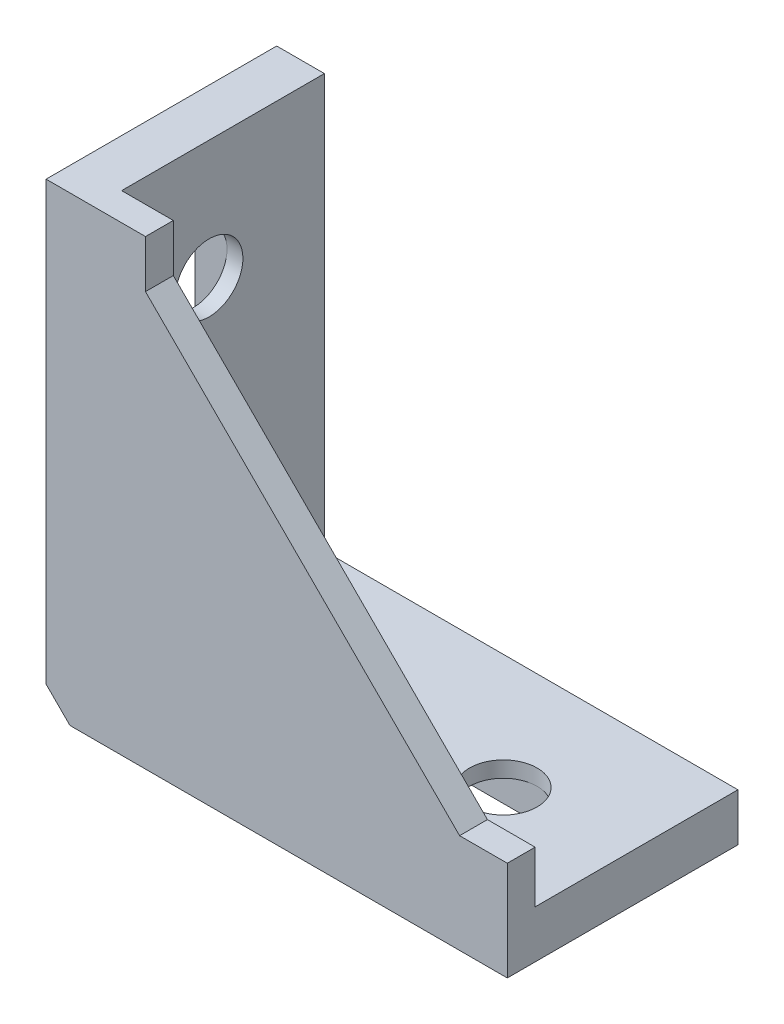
ISO-10303-21;
HEADER;
FILE_DESCRIPTION(('STEP AP214'),'2;1');
FILE_NAME('part.step','',(''),(''),'','','');
FILE_SCHEMA(('AUTOMOTIVE_DESIGN { 1 0 10303 214 1 1 1 1 }'));
ENDSEC;
DATA;
#1=APPLICATION_CONTEXT('core data for automotive mechanical design processes');
#2=APPLICATION_PROTOCOL_DEFINITION('international standard','automotive_design',2000,#1);
#3=PRODUCT_CONTEXT('',#1,'mechanical');
#4=PRODUCT('Part','Part','',(#3));
#5=PRODUCT_RELATED_PRODUCT_CATEGORY('part','',(#4));
#6=PRODUCT_DEFINITION_FORMATION('','',#4);
#7=PRODUCT_DEFINITION_CONTEXT('part definition',#1,'design');
#8=PRODUCT_DEFINITION('design','',#6,#7);
#9=PRODUCT_DEFINITION_SHAPE('','',#8);
#10=(LENGTH_UNIT() NAMED_UNIT(*) SI_UNIT(.MILLI.,.METRE.));
#11=(NAMED_UNIT(*) PLANE_ANGLE_UNIT() SI_UNIT($,.RADIAN.));
#12=(NAMED_UNIT(*) SI_UNIT($,.STERADIAN.) SOLID_ANGLE_UNIT());
#13=UNCERTAINTY_MEASURE_WITH_UNIT(LENGTH_MEASURE(1.E-05),#10,'distance_accuracy_value','');
#14=(GEOMETRIC_REPRESENTATION_CONTEXT(3) GLOBAL_UNCERTAINTY_ASSIGNED_CONTEXT((#13)) GLOBAL_UNIT_ASSIGNED_CONTEXT((#10,
#11,#12)) REPRESENTATION_CONTEXT('',''));
#15=CARTESIAN_POINT('',(0.,0.,0.));
#16=DIRECTION('',(0.,0.,1.));
#17=DIRECTION('',(1.,0.,0.));
#18=AXIS2_PLACEMENT_3D('',#15,#16,#17);
#19=CARTESIAN_POINT('',(-42.3884242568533,-0.51625172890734,29.));
#20=DIRECTION('',(1.,0.,0.));
#21=DIRECTION('',(0.,0.,-1.));
#22=AXIS2_PLACEMENT_3D('',#19,#20,#21);
#23=PLANE('',#22);
#24=DIRECTION('',(0.,1.,0.));
#25=VECTOR('',#24,1.);
#26=CARTESIAN_POINT('',(-42.3884242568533,-22.0960017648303,21.5));
#27=LINE('',#26,#25);
#28=CARTESIAN_POINT('',(-42.3884242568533,5.88069288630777,21.5));
#29=VERTEX_POINT('',#28);
#30=CARTESIAN_POINT('',(-42.3884242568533,53.6601801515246,21.5));
#31=VERTEX_POINT('',#30);
#32=EDGE_CURVE('E593',#29,#31,#27,.T.);
#33=ORIENTED_EDGE('',*,*,#32,.T.);
#34=DIRECTION('',(0.,0.,1.));
#35=VECTOR('',#34,1.);
#36=CARTESIAN_POINT('',(-42.3884242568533,53.6601801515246,14.5));
#37=LINE('',#36,#35);
#38=CARTESIAN_POINT('',(-42.3884242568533,53.6601801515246,25.5));
#39=VERTEX_POINT('',#38);
#40=EDGE_CURVE('E586',#31,#39,#37,.T.);
#41=ORIENTED_EDGE('',*,*,#40,.T.);
#42=DIRECTION('',(0.,-1.,0.));
#43=VECTOR('',#42,1.);
#44=CARTESIAN_POINT('',(-42.3884242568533,-22.0960017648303,25.5));
#45=LINE('',#44,#43);
#46=CARTESIAN_POINT('',(-42.3884242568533,5.88069288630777,25.5));
#47=VERTEX_POINT('',#46);
#48=EDGE_CURVE('E599',#39,#47,#45,.T.);
#49=ORIENTED_EDGE('',*,*,#48,.T.);
#50=DIRECTION('',(0.,0.,-1.));
#51=VECTOR('',#50,1.);
#52=CARTESIAN_POINT('',(-42.3884242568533,5.88069288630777,14.5));
#53=LINE('',#52,#51);
#54=EDGE_CURVE('E596',#47,#29,#53,.T.);
#55=ORIENTED_EDGE('',*,*,#54,.T.);
#56=EDGE_LOOP('',(#33,#41,#49,#55));
#57=FACE_BOUND('',#56,.T.);
#58=DIRECTION('',(0.,-1.,0.));
#59=VECTOR('',#58,1.);
#60=CARTESIAN_POINT('',(-42.3884242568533,-0.51625172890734,0.));
#61=LINE('',#60,#59);
#62=CARTESIAN_POINT('',(-42.3884242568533,57.4837482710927,0.));
#63=VERTEX_POINT('',#62);
#64=CARTESIAN_POINT('',(-42.3884242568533,2.48374827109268,0.));
#65=VERTEX_POINT('',#64);
#66=EDGE_CURVE('E735',#63,#65,#61,.T.);
#67=ORIENTED_EDGE('',*,*,#66,.T.);
#68=DIRECTION('',(0.,0.,1.));
#69=VECTOR('',#68,1.);
#70=CARTESIAN_POINT('',(-42.3884242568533,2.48374827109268,29.));
#71=LINE('',#70,#69);
#72=CARTESIAN_POINT('',(-42.3884242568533,2.48374827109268,29.));
#73=VERTEX_POINT('',#72);
#74=EDGE_CURVE('E67',#65,#73,#71,.T.);
#75=ORIENTED_EDGE('',*,*,#74,.T.);
#76=DIRECTION('',(0.,-1.,0.));
#77=VECTOR('',#76,1.);
#78=CARTESIAN_POINT('',(-42.3884242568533,-0.51625172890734,29.));
#79=LINE('',#78,#77);
#80=CARTESIAN_POINT('',(-42.3884242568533,57.4837482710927,29.));
#81=VERTEX_POINT('',#80);
#82=EDGE_CURVE('E742',#81,#73,#79,.T.);
#83=ORIENTED_EDGE('',*,*,#82,.F.);
#84=DIRECTION('',(0.,0.,-1.));
#85=VECTOR('',#84,1.);
#86=CARTESIAN_POINT('',(-42.3884242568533,57.4837482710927,29.));
#87=LINE('',#86,#85);
#88=EDGE_CURVE('E751',#81,#63,#87,.T.);
#89=ORIENTED_EDGE('',*,*,#88,.T.);
#90=EDGE_LOOP('',(#67,#75,#83,#89));
#91=FACE_BOUND('',#90,.T.);
#92=DIRECTION('',(0.,1.,0.));
#93=VECTOR('',#92,1.);
#94=CARTESIAN_POINT('',(-42.3884242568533,-22.0960017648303,3.5));
#95=LINE('',#94,#93);
#96=CARTESIAN_POINT('',(-42.3884242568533,6.48374827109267,3.5));
#97=VERTEX_POINT('',#96);
#98=CARTESIAN_POINT('',(-42.3884242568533,53.6601801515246,3.5));
#99=VERTEX_POINT('',#98);
#100=EDGE_CURVE('E640',#97,#99,#95,.T.);
#101=ORIENTED_EDGE('',*,*,#100,.T.);
#102=DIRECTION('',(0.,0.,1.));
#103=VECTOR('',#102,1.);
#104=CARTESIAN_POINT('',(-42.3884242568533,53.6601801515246,14.5));
#105=LINE('',#104,#103);
#106=CARTESIAN_POINT('',(-42.3884242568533,53.6601801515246,8.5));
#107=VERTEX_POINT('',#106);
#108=EDGE_CURVE('E645',#99,#107,#105,.T.);
#109=ORIENTED_EDGE('',*,*,#108,.T.);
#110=DIRECTION('',(0.,-1.,0.));
#111=VECTOR('',#110,1.);
#112=CARTESIAN_POINT('',(-42.3884242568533,-22.0960017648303,8.50000000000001));
#113=LINE('',#112,#111);
#114=CARTESIAN_POINT('',(-42.3884242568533,6.48374827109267,8.50000000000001));
#115=VERTEX_POINT('',#114);
#116=EDGE_CURVE('E657',#107,#115,#113,.T.);
#117=ORIENTED_EDGE('',*,*,#116,.T.);
#118=DIRECTION('',(0.,0.,-1.));
#119=VECTOR('',#118,1.);
#120=CARTESIAN_POINT('',(-42.3884242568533,6.48374827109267,14.5));
#121=LINE('',#120,#119);
#122=EDGE_CURVE('E654',#115,#97,#121,.T.);
#123=ORIENTED_EDGE('',*,*,#122,.T.);
#124=EDGE_LOOP('',(#101,#109,#117,#123));
#125=FACE_BOUND('',#124,.T.);
#126=DIRECTION('',(0.,0.,1.));
#127=VECTOR('',#126,1.);
#128=CARTESIAN_POINT('',(-42.3884242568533,50.4837482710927,12.));
#129=LINE('',#128,#127);
#130=CARTESIAN_POINT('',(-42.3884242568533,50.4837482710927,18.75));
#131=VERTEX_POINT('',#130);
#132=CARTESIAN_POINT('',(-42.3884242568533,50.4837482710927,19.));
#133=VERTEX_POINT('',#132);
#134=EDGE_CURVE('E515',#131,#133,#129,.T.);
#135=ORIENTED_EDGE('',*,*,#134,.F.);
#136=DIRECTION('',(0.,-1.,0.));
#137=VECTOR('',#136,1.);
#138=CARTESIAN_POINT('',(-42.3884242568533,-22.0960017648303,18.75));
#139=LINE('',#138,#137);
#140=CARTESIAN_POINT('',(-42.3884242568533,6.48374827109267,18.75));
#141=VERTEX_POINT('',#140);
#142=EDGE_CURVE('E674',#131,#141,#139,.T.);
#143=ORIENTED_EDGE('',*,*,#142,.T.);
#144=DIRECTION('',(0.,0.,-1.));
#145=VECTOR('',#144,1.);
#146=CARTESIAN_POINT('',(-42.3884242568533,6.48374827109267,19.));
#147=LINE('',#146,#145);
#148=CARTESIAN_POINT('',(-42.3884242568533,6.48374827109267,19.));
#149=VERTEX_POINT('',#148);
#150=EDGE_CURVE('E1184',#149,#141,#147,.T.);
#151=ORIENTED_EDGE('',*,*,#150,.F.);
#152=DIRECTION('',(0.,1.,0.));
#153=VECTOR('',#152,1.);
#154=CARTESIAN_POINT('',(-42.3884242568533,4.48374827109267,19.));
#155=LINE('',#154,#153);
#156=CARTESIAN_POINT('',(-42.3884242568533,4.48374827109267,19.));
#157=VERTEX_POINT('',#156);
#158=EDGE_CURVE('E1198',#157,#149,#155,.T.);
#159=ORIENTED_EDGE('',*,*,#158,.F.);
#160=DIRECTION('',(0.,0.,1.));
#161=VECTOR('',#160,1.);
#162=CARTESIAN_POINT('',(-42.3884242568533,4.48374827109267,12.));
#163=LINE('',#162,#161);
#164=CARTESIAN_POINT('',(-42.3884242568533,4.48374827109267,12.));
#165=VERTEX_POINT('',#164);
#166=EDGE_CURVE('E1205',#165,#157,#163,.T.);
#167=ORIENTED_EDGE('',*,*,#166,.F.);
#168=DIRECTION('',(0.,-1.,0.));
#169=VECTOR('',#168,1.);
#170=CARTESIAN_POINT('',(-42.3884242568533,6.48374827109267,12.));
#171=LINE('',#170,#169);
#172=CARTESIAN_POINT('',(-42.3884242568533,6.48374827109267,12.));
#173=VERTEX_POINT('',#172);
#174=EDGE_CURVE('E1188',#173,#165,#171,.T.);
#175=ORIENTED_EDGE('',*,*,#174,.F.);
#176=DIRECTION('',(0.,0.,-1.));
#177=VECTOR('',#176,1.);
#178=CARTESIAN_POINT('',(-42.3884242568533,6.48374827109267,14.5));
#179=LINE('',#178,#177);
#180=CARTESIAN_POINT('',(-42.3884242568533,6.48374827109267,10.25));
#181=VERTEX_POINT('',#180);
#182=EDGE_CURVE('E566',#173,#181,#179,.T.);
#183=ORIENTED_EDGE('',*,*,#182,.T.);
#184=DIRECTION('',(0.,-1.,0.));
#185=VECTOR('',#184,1.);
#186=CARTESIAN_POINT('',(-42.3884242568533,-22.0960017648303,10.25));
#187=LINE('',#186,#185);
#188=CARTESIAN_POINT('',(-42.3884242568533,50.4837482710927,10.25));
#189=VERTEX_POINT('',#188);
#190=EDGE_CURVE('E665',#189,#181,#187,.T.);
#191=ORIENTED_EDGE('',*,*,#190,.F.);
#192=DIRECTION('',(0.,0.,1.));
#193=VECTOR('',#192,1.);
#194=CARTESIAN_POINT('',(-42.3884242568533,50.4837482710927,14.5));
#195=LINE('',#194,#193);
#196=CARTESIAN_POINT('',(-42.3884242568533,50.4837482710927,12.));
#197=VERTEX_POINT('',#196);
#198=EDGE_CURVE('E620',#189,#197,#195,.T.);
#199=ORIENTED_EDGE('',*,*,#198,.T.);
#200=DIRECTION('',(0.,-1.,0.));
#201=VECTOR('',#200,1.);
#202=CARTESIAN_POINT('',(-42.3884242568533,52.4837482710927,12.));
#203=LINE('',#202,#201);
#204=CARTESIAN_POINT('',(-42.3884242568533,52.4837482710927,12.));
#205=VERTEX_POINT('',#204);
#206=EDGE_CURVE('E1288',#205,#197,#203,.T.);
#207=ORIENTED_EDGE('',*,*,#206,.F.);
#208=DIRECTION('',(0.,0.,-1.));
#209=VECTOR('',#208,1.);
#210=CARTESIAN_POINT('',(-42.3884242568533,52.4837482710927,19.));
#211=LINE('',#210,#209);
#212=CARTESIAN_POINT('',(-42.3884242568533,52.4837482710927,19.));
#213=VERTEX_POINT('',#212);
#214=EDGE_CURVE('E1295',#213,#205,#211,.T.);
#215=ORIENTED_EDGE('',*,*,#214,.F.);
#216=DIRECTION('',(0.,1.,0.));
#217=VECTOR('',#216,1.);
#218=CARTESIAN_POINT('',(-42.3884242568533,50.4837482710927,19.));
#219=LINE('',#218,#217);
#220=EDGE_CURVE('E1177',#133,#213,#219,.T.);
#221=ORIENTED_EDGE('',*,*,#220,.F.);
#222=EDGE_LOOP('',(#135,#143,#151,#159,#167,#175,#183,#191,#199,#207,#215,#221));
#223=FACE_BOUND('',#222,.T.);
#224=ADVANCED_FACE('F59',(#57,#91,#125,#223),#23,.F.);
#225=CARTESIAN_POINT('',(-27.3884242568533,57.4837482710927,14.5));
#226=DIRECTION('',(0.,-1.,0.));
#227=DIRECTION('',(1.,0.,0.));
#228=AXIS2_PLACEMENT_3D('',#225,#226,#227);
#229=CYLINDRICAL_SURFACE('',#228,4.25);
#230=DIRECTION('',(0.,-1.,0.));
#231=VECTOR('',#230,1.);
#232=CARTESIAN_POINT('',(-27.3884242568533,57.4837482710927,18.75));
#233=LINE('',#232,#231);
#234=CARTESIAN_POINT('',(-27.3884242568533,5.48374827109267,18.75));
#235=VERTEX_POINT('',#234);
#236=CARTESIAN_POINT('',(-27.3884242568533,3.48374827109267,18.75));
#237=VERTEX_POINT('',#236);
#238=EDGE_CURVE('E1128',#235,#237,#233,.T.);
#239=ORIENTED_EDGE('',*,*,#238,.T.);
#240=CARTESIAN_POINT('',(-27.3884242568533,3.48374827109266,14.5));
#241=DIRECTION('',(0.,1.,0.));
#242=DIRECTION('',(0.,0.,1.));
#243=AXIS2_PLACEMENT_3D('',#240,#241,#242);
#244=CIRCLE('',#243,4.25);
#245=CARTESIAN_POINT('',(-27.3884242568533,3.48374827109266,10.25));
#246=VERTEX_POINT('',#245);
#247=EDGE_CURVE('E1221',#237,#246,#244,.F.);
#248=ORIENTED_EDGE('',*,*,#247,.T.);
#249=DIRECTION('',(0.,-1.,0.));
#250=VECTOR('',#249,1.);
#251=CARTESIAN_POINT('',(-27.3884242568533,57.4837482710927,10.25));
#252=LINE('',#251,#250);
#253=CARTESIAN_POINT('',(-27.3884242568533,5.48374827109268,10.25));
#254=VERTEX_POINT('',#253);
#255=EDGE_CURVE('E1125',#254,#246,#252,.T.);
#256=ORIENTED_EDGE('',*,*,#255,.F.);
#257=CARTESIAN_POINT('',(-27.3884242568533,5.48374827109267,14.5));
#258=DIRECTION('',(0.,-1.,0.));
#259=DIRECTION('',(0.,0.,-1.));
#260=AXIS2_PLACEMENT_3D('',#257,#258,#259);
#261=CIRCLE('',#260,4.25);
#262=EDGE_CURVE('E1134',#254,#235,#261,.F.);
#263=ORIENTED_EDGE('',*,*,#262,.T.);
#264=EDGE_LOOP('',(#239,#248,#256,#263));
#265=FACE_BOUND('',#264,.T.);
#266=ADVANCED_FACE('F794',(#265),#229,.F.);
#267=CARTESIAN_POINT('',(0.611575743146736,57.4837482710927,14.5));
#268=DIRECTION('',(0.,-1.,0.));
#269=DIRECTION('',(1.,0.,0.));
#270=AXIS2_PLACEMENT_3D('',#267,#268,#269);
#271=CYLINDRICAL_SURFACE('',#270,4.25);
#272=CARTESIAN_POINT('',(0.611575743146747,5.48374827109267,14.5));
#273=DIRECTION('',(0.,-1.,0.));
#274=DIRECTION('',(0.,0.,-1.));
#275=AXIS2_PLACEMENT_3D('',#272,#273,#274);
#276=CIRCLE('',#275,4.25);
#277=CARTESIAN_POINT('',(0.611575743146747,5.48374827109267,10.25));
#278=VERTEX_POINT('',#277);
#279=EDGE_CURVE('E570',#278,#278,#276,.F.);
#280=ORIENTED_EDGE('',*,*,#279,.T.);
#281=EDGE_LOOP('',(#280));
#282=FACE_BOUND('',#281,.T.);
#283=CARTESIAN_POINT('',(0.611575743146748,3.48374827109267,14.5));
#284=DIRECTION('',(0.,1.,0.));
#285=DIRECTION('',(0.,0.,1.));
#286=AXIS2_PLACEMENT_3D('',#283,#284,#285);
#287=CIRCLE('',#286,4.25);
#288=CARTESIAN_POINT('',(0.611575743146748,3.48374827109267,18.75));
#289=VERTEX_POINT('',#288);
#290=CARTESIAN_POINT('',(0.611575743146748,3.48374827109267,10.25));
#291=VERTEX_POINT('',#290);
#292=EDGE_CURVE('E1080',#289,#291,#287,.F.);
#293=ORIENTED_EDGE('',*,*,#292,.T.);
#294=CARTESIAN_POINT('',(0.611575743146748,3.48374827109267,14.5));
#295=DIRECTION('',(0.,1.,0.));
#296=DIRECTION('',(0.,0.,1.));
#297=AXIS2_PLACEMENT_3D('',#294,#295,#296);
#298=CIRCLE('',#297,4.25);
#299=EDGE_CURVE('E1075',#291,#289,#298,.F.);
#300=ORIENTED_EDGE('',*,*,#299,.T.);
#301=EDGE_LOOP('',(#293,#300));
#302=FACE_BOUND('',#301,.T.);
#303=ADVANCED_FACE('F799',(#282,#302),#271,.F.);
#304=CARTESIAN_POINT('',(-15.3884242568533,57.4837482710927,14.5));
#305=DIRECTION('',(0.,-1.,0.));
#306=DIRECTION('',(1.,0.,0.));
#307=AXIS2_PLACEMENT_3D('',#304,#305,#306);
#308=CYLINDRICAL_SURFACE('',#307,4.25);
#309=DIRECTION('',(0.,-1.,0.));
#310=VECTOR('',#309,1.);
#311=CARTESIAN_POINT('',(-15.3884242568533,57.4837482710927,10.25));
#312=LINE('',#311,#310);
#313=CARTESIAN_POINT('',(-15.3884242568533,5.48374827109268,10.25));
#314=VERTEX_POINT('',#313);
#315=CARTESIAN_POINT('',(-15.3884242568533,3.48374827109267,10.25));
#316=VERTEX_POINT('',#315);
#317=EDGE_CURVE('E1121',#314,#316,#312,.T.);
#318=ORIENTED_EDGE('',*,*,#317,.T.);
#319=CARTESIAN_POINT('',(-15.3884242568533,3.48374827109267,14.5));
#320=DIRECTION('',(0.,1.,0.));
#321=DIRECTION('',(0.,0.,1.));
#322=AXIS2_PLACEMENT_3D('',#319,#320,#321);
#323=CIRCLE('',#322,4.25);
#324=CARTESIAN_POINT('',(-15.3884242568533,3.48374827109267,18.75));
#325=VERTEX_POINT('',#324);
#326=EDGE_CURVE('E1084',#316,#325,#323,.F.);
#327=ORIENTED_EDGE('',*,*,#326,.T.);
#328=DIRECTION('',(0.,-1.,0.));
#329=VECTOR('',#328,1.);
#330=CARTESIAN_POINT('',(-15.3884242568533,57.4837482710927,18.75));
#331=LINE('',#330,#329);
#332=CARTESIAN_POINT('',(-15.3884242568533,5.48374827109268,18.75));
#333=VERTEX_POINT('',#332);
#334=EDGE_CURVE('E1120',#333,#325,#331,.T.);
#335=ORIENTED_EDGE('',*,*,#334,.F.);
#336=CARTESIAN_POINT('',(-15.3884242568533,5.48374827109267,14.5));
#337=DIRECTION('',(0.,-1.,0.));
#338=DIRECTION('',(0.,0.,-1.));
#339=AXIS2_PLACEMENT_3D('',#336,#337,#338);
#340=CIRCLE('',#339,4.25);
#341=EDGE_CURVE('E1139',#333,#314,#340,.F.);
#342=ORIENTED_EDGE('',*,*,#341,.T.);
#343=EDGE_LOOP('',(#318,#327,#335,#342));
#344=FACE_BOUND('',#343,.T.);
#345=ADVANCED_FACE('F813',(#344),#308,.F.);
#346=CARTESIAN_POINT('',(-36.3884242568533,5.48374827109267,29.));
#347=DIRECTION('',(0.,-1.,0.));
#348=DIRECTION('',(0.,0.,-1.));
#349=AXIS2_PLACEMENT_3D('',#346,#347,#348);
#350=PLANE('',#349);
#351=ORIENTED_EDGE('',*,*,#279,.F.);
#352=EDGE_LOOP('',(#351));
#353=FACE_BOUND('',#352,.T.);
#354=DIRECTION('',(1.,0.,0.));
#355=VECTOR('',#354,1.);
#356=CARTESIAN_POINT('',(-36.3884242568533,5.48374827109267,25.5));
#357=LINE('',#356,#355);
#358=CARTESIAN_POINT('',(-36.3884242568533,5.48374827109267,25.5));
#359=VERTEX_POINT('',#358);
#360=CARTESIAN_POINT('',(15.6115757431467,5.48374827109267,25.5));
#361=VERTEX_POINT('',#360);
#362=EDGE_CURVE('E705',#359,#361,#357,.T.);
#363=ORIENTED_EDGE('',*,*,#362,.T.);
#364=DIRECTION('',(0.,0.,-1.));
#365=VECTOR('',#364,1.);
#366=CARTESIAN_POINT('',(15.6115757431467,5.48374827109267,29.));
#367=LINE('',#366,#365);
#368=CARTESIAN_POINT('',(15.6115757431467,5.48374827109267,0.));
#369=VERTEX_POINT('',#368);
#370=EDGE_CURVE('E555',#361,#369,#367,.T.);
#371=ORIENTED_EDGE('',*,*,#370,.T.);
#372=DIRECTION('',(-1.,0.,0.));
#373=VECTOR('',#372,1.);
#374=CARTESIAN_POINT('',(-36.3884242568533,5.48374827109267,0.));
#375=LINE('',#374,#373);
#376=CARTESIAN_POINT('',(-36.3884242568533,5.48374827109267,0.));
#377=VERTEX_POINT('',#376);
#378=EDGE_CURVE('E757',#369,#377,#375,.T.);
#379=ORIENTED_EDGE('',*,*,#378,.T.);
#380=DIRECTION('',(0.,0.,-1.));
#381=VECTOR('',#380,1.);
#382=CARTESIAN_POINT('',(-36.3884242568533,5.48374827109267,29.));
#383=LINE('',#382,#381);
#384=EDGE_CURVE('E562',#359,#377,#383,.T.);
#385=ORIENTED_EDGE('',*,*,#384,.F.);
#386=EDGE_LOOP('',(#363,#371,#379,#385));
#387=FACE_BOUND('',#386,.T.);
#388=ORIENTED_EDGE('',*,*,#341,.F.);
#389=DIRECTION('',(-1.,0.,0.));
#390=VECTOR('',#389,1.);
#391=CARTESIAN_POINT('',(-36.3884242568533,5.48374827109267,18.75));
#392=LINE('',#391,#390);
#393=EDGE_CURVE('E1124',#333,#235,#392,.T.);
#394=ORIENTED_EDGE('',*,*,#393,.T.);
#395=ORIENTED_EDGE('',*,*,#262,.F.);
#396=DIRECTION('',(-1.,0.,0.));
#397=VECTOR('',#396,1.);
#398=CARTESIAN_POINT('',(-36.3884242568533,5.48374827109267,10.25));
#399=LINE('',#398,#397);
#400=EDGE_CURVE('E1137',#314,#254,#399,.T.);
#401=ORIENTED_EDGE('',*,*,#400,.F.);
#402=EDGE_LOOP('',(#388,#394,#395,#401));
#403=FACE_BOUND('',#402,.T.);
#404=ADVANCED_FACE('F775',(#353,#387,#403),#350,.F.);
#405=CARTESIAN_POINT('',(15.6115757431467,-0.51625172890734,29.));
#406=DIRECTION('',(0.,1.,0.));
#407=DIRECTION('',(0.,0.,1.));
#408=AXIS2_PLACEMENT_3D('',#405,#406,#407);
#409=PLANE('',#408);
#410=DIRECTION('',(-1.,0.,0.));
#411=VECTOR('',#410,1.);
#412=CARTESIAN_POINT('',(-63.9681742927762,-0.516251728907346,18.75));
#413=LINE('',#412,#411);
#414=CARTESIAN_POINT('',(8.61157574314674,-0.516251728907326,18.75));
#415=VERTEX_POINT('',#414);
#416=CARTESIAN_POINT('',(-35.3884242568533,-0.51625172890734,18.75));
#417=VERTEX_POINT('',#416);
#418=EDGE_CURVE('E533',#415,#417,#413,.T.);
#419=ORIENTED_EDGE('',*,*,#418,.F.);
#420=DIRECTION('',(0.,0.,1.));
#421=VECTOR('',#420,1.);
#422=CARTESIAN_POINT('',(8.61157574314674,-0.516251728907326,12.));
#423=LINE('',#422,#421);
#424=CARTESIAN_POINT('',(8.61157574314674,-0.516251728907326,19.));
#425=VERTEX_POINT('',#424);
#426=EDGE_CURVE('E474',#415,#425,#423,.T.);
#427=ORIENTED_EDGE('',*,*,#426,.T.);
#428=DIRECTION('',(1.,0.,0.));
#429=VECTOR('',#428,1.);
#430=CARTESIAN_POINT('',(8.61157574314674,-0.516251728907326,19.));
#431=LINE('',#430,#429);
#432=CARTESIAN_POINT('',(10.6115757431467,-0.516251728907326,19.));
#433=VERTEX_POINT('',#432);
#434=EDGE_CURVE('E465',#425,#433,#431,.T.);
#435=ORIENTED_EDGE('',*,*,#434,.T.);
#436=DIRECTION('',(0.,0.,-1.));
#437=VECTOR('',#436,1.);
#438=CARTESIAN_POINT('',(10.6115757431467,-0.516251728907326,19.));
#439=LINE('',#438,#437);
#440=CARTESIAN_POINT('',(10.6115757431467,-0.516251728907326,12.));
#441=VERTEX_POINT('',#440);
#442=EDGE_CURVE('E479',#433,#441,#439,.T.);
#443=ORIENTED_EDGE('',*,*,#442,.T.);
#444=DIRECTION('',(-1.,0.,0.));
#445=VECTOR('',#444,1.);
#446=CARTESIAN_POINT('',(10.6115757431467,-0.516251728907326,12.));
#447=LINE('',#446,#445);
#448=CARTESIAN_POINT('',(8.61157574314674,-0.516251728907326,12.));
#449=VERTEX_POINT('',#448);
#450=EDGE_CURVE('E477',#441,#449,#447,.T.);
#451=ORIENTED_EDGE('',*,*,#450,.T.);
#452=DIRECTION('',(0.,0.,1.));
#453=VECTOR('',#452,1.);
#454=CARTESIAN_POINT('',(8.61157574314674,-0.516251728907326,14.5));
#455=LINE('',#454,#453);
#456=CARTESIAN_POINT('',(8.61157574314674,-0.516251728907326,10.25));
#457=VERTEX_POINT('',#456);
#458=EDGE_CURVE('E449',#457,#449,#455,.T.);
#459=ORIENTED_EDGE('',*,*,#458,.F.);
#460=DIRECTION('',(-1.,0.,0.));
#461=VECTOR('',#460,1.);
#462=CARTESIAN_POINT('',(-63.9681742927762,-0.516251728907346,10.25));
#463=LINE('',#462,#461);
#464=CARTESIAN_POINT('',(-35.3884242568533,-0.51625172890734,10.25));
#465=VERTEX_POINT('',#464);
#466=EDGE_CURVE('E536',#457,#465,#463,.T.);
#467=ORIENTED_EDGE('',*,*,#466,.T.);
#468=DIRECTION('',(0.,0.,-1.));
#469=VECTOR('',#468,1.);
#470=CARTESIAN_POINT('',(-35.3884242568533,-0.51625172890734,14.5));
#471=LINE('',#470,#469);
#472=CARTESIAN_POINT('',(-35.3884242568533,-0.51625172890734,12.));
#473=VERTEX_POINT('',#472);
#474=EDGE_CURVE('E523',#473,#465,#471,.T.);
#475=ORIENTED_EDGE('',*,*,#474,.F.);
#476=DIRECTION('',(-1.,0.,0.));
#477=VECTOR('',#476,1.);
#478=CARTESIAN_POINT('',(-35.3884242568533,-0.51625172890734,12.));
#479=LINE('',#478,#477);
#480=CARTESIAN_POINT('',(-37.3884242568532,-0.51625172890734,12.));
#481=VERTEX_POINT('',#480);
#482=EDGE_CURVE('E492',#473,#481,#479,.T.);
#483=ORIENTED_EDGE('',*,*,#482,.T.);
#484=DIRECTION('',(0.,0.,1.));
#485=VECTOR('',#484,1.);
#486=CARTESIAN_POINT('',(-37.3884242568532,-0.51625172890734,12.));
#487=LINE('',#486,#485);
#488=CARTESIAN_POINT('',(-37.3884242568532,-0.51625172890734,19.));
#489=VERTEX_POINT('',#488);
#490=EDGE_CURVE('E505',#481,#489,#487,.T.);
#491=ORIENTED_EDGE('',*,*,#490,.T.);
#492=DIRECTION('',(1.,0.,0.));
#493=VECTOR('',#492,1.);
#494=CARTESIAN_POINT('',(-37.3884242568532,-0.51625172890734,19.));
#495=LINE('',#494,#493);
#496=CARTESIAN_POINT('',(-35.3884242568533,-0.51625172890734,19.));
#497=VERTEX_POINT('',#496);
#498=EDGE_CURVE('E502',#489,#497,#495,.T.);
#499=ORIENTED_EDGE('',*,*,#498,.T.);
#500=DIRECTION('',(0.,0.,-1.));
#501=VECTOR('',#500,1.);
#502=CARTESIAN_POINT('',(-35.3884242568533,-0.51625172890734,19.));
#503=LINE('',#502,#501);
#504=EDGE_CURVE('E454',#497,#417,#503,.T.);
#505=ORIENTED_EDGE('',*,*,#504,.T.);
#506=EDGE_LOOP('',(#419,#427,#435,#443,#451,#459,#467,#475,#483,#491,#499,#505));
#507=FACE_BOUND('',#506,.T.);
#508=DIRECTION('',(0.,0.,1.));
#509=VECTOR('',#508,1.);
#510=CARTESIAN_POINT('',(11.7880076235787,-0.516251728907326,14.5));
#511=LINE('',#510,#509);
#512=CARTESIAN_POINT('',(11.7880076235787,-0.51625172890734,21.5));
#513=VERTEX_POINT('',#512);
#514=CARTESIAN_POINT('',(11.7880076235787,-0.516251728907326,25.5));
#515=VERTEX_POINT('',#514);
#516=EDGE_CURVE('E1248',#513,#515,#511,.T.);
#517=ORIENTED_EDGE('',*,*,#516,.F.);
#518=DIRECTION('',(1.,0.,0.));
#519=VECTOR('',#518,1.);
#520=CARTESIAN_POINT('',(-63.9681742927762,-0.516251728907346,21.5));
#521=LINE('',#520,#519);
#522=CARTESIAN_POINT('',(-35.9914796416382,-0.51625172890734,21.5));
#523=VERTEX_POINT('',#522);
#524=EDGE_CURVE('E1232',#523,#513,#521,.T.);
#525=ORIENTED_EDGE('',*,*,#524,.F.);
#526=DIRECTION('',(0.,0.,-1.));
#527=VECTOR('',#526,1.);
#528=CARTESIAN_POINT('',(-35.9914796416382,-0.51625172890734,14.5));
#529=LINE('',#528,#527);
#530=CARTESIAN_POINT('',(-35.9914796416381,-0.51625172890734,25.5));
#531=VERTEX_POINT('',#530);
#532=EDGE_CURVE('E1237',#531,#523,#529,.T.);
#533=ORIENTED_EDGE('',*,*,#532,.F.);
#534=DIRECTION('',(-1.,0.,0.));
#535=VECTOR('',#534,1.);
#536=CARTESIAN_POINT('',(-63.9681742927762,-0.516251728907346,25.5));
#537=LINE('',#536,#535);
#538=EDGE_CURVE('E1251',#515,#531,#537,.T.);
#539=ORIENTED_EDGE('',*,*,#538,.F.);
#540=EDGE_LOOP('',(#517,#525,#533,#539));
#541=FACE_BOUND('',#540,.T.);
#542=DIRECTION('',(0.,0.,1.));
#543=VECTOR('',#542,1.);
#544=CARTESIAN_POINT('',(11.7880076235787,-0.516251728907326,14.5));
#545=LINE('',#544,#543);
#546=CARTESIAN_POINT('',(11.7880076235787,-0.51625172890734,3.5));
#547=VERTEX_POINT('',#546);
#548=CARTESIAN_POINT('',(11.7880076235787,-0.516251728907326,8.5));
#549=VERTEX_POINT('',#548);
#550=EDGE_CURVE('E1103',#547,#549,#545,.T.);
#551=ORIENTED_EDGE('',*,*,#550,.F.);
#552=DIRECTION('',(1.,0.,0.));
#553=VECTOR('',#552,1.);
#554=CARTESIAN_POINT('',(-63.9681742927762,-0.516251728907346,3.5));
#555=LINE('',#554,#553);
#556=CARTESIAN_POINT('',(-35.3884242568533,-0.51625172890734,3.5));
#557=VERTEX_POINT('',#556);
#558=EDGE_CURVE('E1087',#557,#547,#555,.T.);
#559=ORIENTED_EDGE('',*,*,#558,.F.);
#560=DIRECTION('',(0.,0.,-1.));
#561=VECTOR('',#560,1.);
#562=CARTESIAN_POINT('',(-35.3884242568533,-0.51625172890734,14.5));
#563=LINE('',#562,#561);
#564=CARTESIAN_POINT('',(-35.3884242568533,-0.51625172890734,8.50000000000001));
#565=VERTEX_POINT('',#564);
#566=EDGE_CURVE('E1092',#565,#557,#563,.T.);
#567=ORIENTED_EDGE('',*,*,#566,.F.);
#568=DIRECTION('',(-1.,0.,0.));
#569=VECTOR('',#568,1.);
#570=CARTESIAN_POINT('',(-63.9681742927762,-0.516251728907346,8.50000000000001));
#571=LINE('',#570,#569);
#572=EDGE_CURVE('E1106',#549,#565,#571,.T.);
#573=ORIENTED_EDGE('',*,*,#572,.F.);
#574=EDGE_LOOP('',(#551,#559,#567,#573));
#575=FACE_BOUND('',#574,.T.);
#576=DIRECTION('',(1.,0.,0.));
#577=VECTOR('',#576,1.);
#578=CARTESIAN_POINT('',(15.6115757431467,-0.51625172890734,29.));
#579=LINE('',#578,#577);
#580=CARTESIAN_POINT('',(-39.3884242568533,-0.516251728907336,29.));
#581=VERTEX_POINT('',#580);
#582=CARTESIAN_POINT('',(15.6115757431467,-0.51625172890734,29.));
#583=VERTEX_POINT('',#582);
#584=EDGE_CURVE('E744',#581,#583,#579,.T.);
#585=ORIENTED_EDGE('',*,*,#584,.F.);
#586=DIRECTION('',(0.,0.,-1.));
#587=VECTOR('',#586,1.);
#588=CARTESIAN_POINT('',(-39.3884242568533,-0.51625172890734,29.));
#589=LINE('',#588,#587);
#590=CARTESIAN_POINT('',(-39.3884242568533,-0.516251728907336,0.));
#591=VERTEX_POINT('',#590);
#592=EDGE_CURVE('E547',#581,#591,#589,.T.);
#593=ORIENTED_EDGE('',*,*,#592,.T.);
#594=DIRECTION('',(1.,0.,0.));
#595=VECTOR('',#594,1.);
#596=CARTESIAN_POINT('',(15.6115757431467,-0.51625172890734,0.));
#597=LINE('',#596,#595);
#598=CARTESIAN_POINT('',(15.6115757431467,-0.51625172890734,0.));
#599=VERTEX_POINT('',#598);
#600=EDGE_CURVE('E753',#591,#599,#597,.T.);
#601=ORIENTED_EDGE('',*,*,#600,.T.);
#602=DIRECTION('',(0.,0.,-1.));
#603=VECTOR('',#602,1.);
#604=CARTESIAN_POINT('',(15.6115757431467,-0.51625172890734,29.));
#605=LINE('',#604,#603);
#606=EDGE_CURVE('E550',#583,#599,#605,.T.);
#607=ORIENTED_EDGE('',*,*,#606,.F.);
#608=EDGE_LOOP('',(#585,#593,#601,#607));
#609=FACE_BOUND('',#608,.T.);
#610=ADVANCED_FACE('F803',(#507,#541,#575,#609),#409,.F.);
#611=CARTESIAN_POINT('',(15.6115757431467,14.4837482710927,14.5));
#612=DIRECTION('',(-1.,0.,0.));
#613=DIRECTION('',(0.,0.,1.));
#614=AXIS2_PLACEMENT_3D('',#611,#612,#613);
#615=CYLINDRICAL_SURFACE('',#614,4.25);
#616=CARTESIAN_POINT('',(-38.3884242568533,14.4837482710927,14.5));
#617=DIRECTION('',(-1.,0.,0.));
#618=DIRECTION('',(0.,0.,1.));
#619=AXIS2_PLACEMENT_3D('',#616,#617,#618);
#620=CIRCLE('',#619,4.25);
#621=CARTESIAN_POINT('',(-38.3884242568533,14.4837482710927,18.75));
#622=VERTEX_POINT('',#621);
#623=CARTESIAN_POINT('',(-38.3884242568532,14.4837482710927,10.25));
#624=VERTEX_POINT('',#623);
#625=EDGE_CURVE('E576',#622,#624,#620,.F.);
#626=ORIENTED_EDGE('',*,*,#625,.F.);
#627=DIRECTION('',(-1.,0.,0.));
#628=VECTOR('',#627,1.);
#629=CARTESIAN_POINT('',(15.6115757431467,14.4837482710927,18.75));
#630=LINE('',#629,#628);
#631=CARTESIAN_POINT('',(-36.3884242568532,14.4837482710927,18.75));
#632=VERTEX_POINT('',#631);
#633=EDGE_CURVE('E679',#632,#622,#630,.T.);
#634=ORIENTED_EDGE('',*,*,#633,.F.);
#635=CARTESIAN_POINT('',(-36.3884242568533,14.4837482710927,14.5));
#636=DIRECTION('',(-1.,0.,0.));
#637=DIRECTION('',(0.,-1.,0.));
#638=AXIS2_PLACEMENT_3D('',#635,#636,#637);
#639=CIRCLE('',#638,4.25);
#640=CARTESIAN_POINT('',(-36.3884242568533,14.4837482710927,10.25));
#641=VERTEX_POINT('',#640);
#642=EDGE_CURVE('E690',#641,#632,#639,.T.);
#643=ORIENTED_EDGE('',*,*,#642,.F.);
#644=DIRECTION('',(-1.,0.,0.));
#645=VECTOR('',#644,1.);
#646=CARTESIAN_POINT('',(15.6115757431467,14.4837482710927,10.25));
#647=LINE('',#646,#645);
#648=EDGE_CURVE('E682',#641,#624,#647,.T.);
#649=ORIENTED_EDGE('',*,*,#648,.T.);
#650=EDGE_LOOP('',(#626,#634,#643,#649));
#651=FACE_BOUND('',#650,.T.);
#652=ADVANCED_FACE('F806',(#651),#615,.F.);
#653=CARTESIAN_POINT('',(15.6115757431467,42.4837482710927,14.5));
#654=DIRECTION('',(-1.,0.,0.));
#655=DIRECTION('',(0.,0.,1.));
#656=AXIS2_PLACEMENT_3D('',#653,#654,#655);
#657=CYLINDRICAL_SURFACE('',#656,4.25);
#658=CARTESIAN_POINT('',(-36.3884242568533,42.4837482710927,14.5));
#659=DIRECTION('',(-1.,0.,0.));
#660=DIRECTION('',(0.,-1.,0.));
#661=AXIS2_PLACEMENT_3D('',#658,#659,#660);
#662=CIRCLE('',#661,4.25);
#663=CARTESIAN_POINT('',(-36.3884242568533,38.2337482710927,14.5));
#664=VERTEX_POINT('',#663);
#665=EDGE_CURVE('E698',#664,#664,#662,.T.);
#666=ORIENTED_EDGE('',*,*,#665,.F.);
#667=EDGE_LOOP('',(#666));
#668=FACE_BOUND('',#667,.T.);
#669=CARTESIAN_POINT('',(-38.3884242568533,42.4837482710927,14.5));
#670=DIRECTION('',(-1.,0.,0.));
#671=DIRECTION('',(0.,0.,1.));
#672=AXIS2_PLACEMENT_3D('',#669,#670,#671);
#673=CIRCLE('',#672,4.25);
#674=CARTESIAN_POINT('',(-38.3884242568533,42.4837482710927,10.25));
#675=VERTEX_POINT('',#674);
#676=CARTESIAN_POINT('',(-38.3884242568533,42.4837482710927,18.75));
#677=VERTEX_POINT('',#676);
#678=EDGE_CURVE('E615',#675,#677,#673,.F.);
#679=ORIENTED_EDGE('',*,*,#678,.F.);
#680=CARTESIAN_POINT('',(-38.3884242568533,42.4837482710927,14.5));
#681=DIRECTION('',(-1.,0.,0.));
#682=DIRECTION('',(0.,0.,1.));
#683=AXIS2_PLACEMENT_3D('',#680,#681,#682);
#684=CIRCLE('',#683,4.25);
#685=EDGE_CURVE('E637',#677,#675,#684,.F.);
#686=ORIENTED_EDGE('',*,*,#685,.F.);
#687=EDGE_LOOP('',(#679,#686));
#688=FACE_BOUND('',#687,.T.);
#689=ADVANCED_FACE('F842',(#668,#688),#657,.F.);
#690=CARTESIAN_POINT('',(15.6115757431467,26.4837482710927,14.5));
#691=DIRECTION('',(-1.,0.,0.));
#692=DIRECTION('',(0.,0.,1.));
#693=AXIS2_PLACEMENT_3D('',#690,#691,#692);
#694=CYLINDRICAL_SURFACE('',#693,4.25);
#695=CARTESIAN_POINT('',(-38.3884242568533,26.4837482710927,14.5));
#696=DIRECTION('',(-1.,0.,0.));
#697=DIRECTION('',(0.,0.,1.));
#698=AXIS2_PLACEMENT_3D('',#695,#696,#697);
#699=CIRCLE('',#698,4.25);
#700=CARTESIAN_POINT('',(-38.3884242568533,26.4837482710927,10.25));
#701=VERTEX_POINT('',#700);
#702=CARTESIAN_POINT('',(-38.3884242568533,26.4837482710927,18.75));
#703=VERTEX_POINT('',#702);
#704=EDGE_CURVE('E632',#701,#703,#699,.F.);
#705=ORIENTED_EDGE('',*,*,#704,.F.);
#706=DIRECTION('',(-1.,0.,0.));
#707=VECTOR('',#706,1.);
#708=CARTESIAN_POINT('',(15.6115757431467,26.4837482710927,10.25));
#709=LINE('',#708,#707);
#710=CARTESIAN_POINT('',(-36.3884242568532,26.4837482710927,10.25));
#711=VERTEX_POINT('',#710);
#712=EDGE_CURVE('E685',#711,#701,#709,.T.);
#713=ORIENTED_EDGE('',*,*,#712,.F.);
#714=CARTESIAN_POINT('',(-36.3884242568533,26.4837482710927,14.5));
#715=DIRECTION('',(-1.,0.,0.));
#716=DIRECTION('',(0.,-1.,0.));
#717=AXIS2_PLACEMENT_3D('',#714,#715,#716);
#718=CIRCLE('',#717,4.25);
#719=CARTESIAN_POINT('',(-36.3884242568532,26.4837482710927,18.75));
#720=VERTEX_POINT('',#719);
#721=EDGE_CURVE('E695',#720,#711,#718,.T.);
#722=ORIENTED_EDGE('',*,*,#721,.F.);
#723=DIRECTION('',(-1.,0.,0.));
#724=VECTOR('',#723,1.);
#725=CARTESIAN_POINT('',(15.6115757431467,26.4837482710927,18.75));
#726=LINE('',#725,#724);
#727=EDGE_CURVE('E675',#720,#703,#726,.T.);
#728=ORIENTED_EDGE('',*,*,#727,.T.);
#729=EDGE_LOOP('',(#705,#713,#722,#728));
#730=FACE_BOUND('',#729,.T.);
#731=ADVANCED_FACE('F817',(#730),#694,.F.);
#732=CARTESIAN_POINT('',(-36.3884242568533,57.4837482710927,29.));
#733=DIRECTION('',(-1.,0.,0.));
#734=DIRECTION('',(0.,-1.,0.));
#735=AXIS2_PLACEMENT_3D('',#732,#733,#734);
#736=PLANE('',#735);
#737=DIRECTION('',(0.,-1.,0.));
#738=VECTOR('',#737,1.);
#739=CARTESIAN_POINT('',(-36.3884242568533,57.4837482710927,18.75));
#740=LINE('',#739,#738);
#741=EDGE_CURVE('E693',#720,#632,#740,.T.);
#742=ORIENTED_EDGE('',*,*,#741,.F.);
#743=ORIENTED_EDGE('',*,*,#721,.T.);
#744=DIRECTION('',(0.,-1.,0.));
#745=VECTOR('',#744,1.);
#746=CARTESIAN_POINT('',(-36.3884242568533,57.4837482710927,10.25));
#747=LINE('',#746,#745);
#748=EDGE_CURVE('E678',#711,#641,#747,.T.);
#749=ORIENTED_EDGE('',*,*,#748,.T.);
#750=ORIENTED_EDGE('',*,*,#642,.T.);
#751=EDGE_LOOP('',(#742,#743,#749,#750));
#752=FACE_BOUND('',#751,.T.);
#753=ORIENTED_EDGE('',*,*,#665,.T.);
#754=EDGE_LOOP('',(#753));
#755=FACE_BOUND('',#754,.T.);
#756=DIRECTION('',(0.,-1.,0.));
#757=VECTOR('',#756,1.);
#758=CARTESIAN_POINT('',(-36.3884242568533,57.4837482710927,25.5));
#759=LINE('',#758,#757);
#760=CARTESIAN_POINT('',(-36.3884242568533,57.4837482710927,25.5));
#761=VERTEX_POINT('',#760);
#762=EDGE_CURVE('E702',#761,#359,#759,.T.);
#763=ORIENTED_EDGE('',*,*,#762,.T.);
#764=ORIENTED_EDGE('',*,*,#384,.T.);
#765=DIRECTION('',(0.,1.,0.));
#766=VECTOR('',#765,1.);
#767=CARTESIAN_POINT('',(-36.3884242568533,57.4837482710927,0.));
#768=LINE('',#767,#766);
#769=CARTESIAN_POINT('',(-36.3884242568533,57.4837482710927,0.));
#770=VERTEX_POINT('',#769);
#771=EDGE_CURVE('E760',#377,#770,#768,.T.);
#772=ORIENTED_EDGE('',*,*,#771,.T.);
#773=DIRECTION('',(0.,0.,-1.));
#774=VECTOR('',#773,1.);
#775=CARTESIAN_POINT('',(-36.3884242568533,57.4837482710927,29.));
#776=LINE('',#775,#774);
#777=EDGE_CURVE('E766',#761,#770,#776,.T.);
#778=ORIENTED_EDGE('',*,*,#777,.F.);
#779=EDGE_LOOP('',(#763,#764,#772,#778));
#780=FACE_BOUND('',#779,.T.);
#781=ADVANCED_FACE('F769',(#752,#755,#780),#736,.F.);
#782=CARTESIAN_POINT('',(15.6115757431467,5.48374827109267,29.));
#783=DIRECTION('',(-1.,0.,0.));
#784=DIRECTION('',(0.,0.,1.));
#785=AXIS2_PLACEMENT_3D('',#782,#783,#784);
#786=PLANE('',#785);
#787=DIRECTION('',(0.,1.,0.));
#788=VECTOR('',#787,1.);
#789=CARTESIAN_POINT('',(15.6115757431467,5.48374827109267,0.));
#790=LINE('',#789,#788);
#791=EDGE_CURVE('E755',#599,#369,#790,.T.);
#792=ORIENTED_EDGE('',*,*,#791,.T.);
#793=ORIENTED_EDGE('',*,*,#370,.F.);
#794=DIRECTION('',(0.,1.,0.));
#795=VECTOR('',#794,1.);
#796=CARTESIAN_POINT('',(15.6115757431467,5.48374827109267,25.5));
#797=LINE('',#796,#795);
#798=CARTESIAN_POINT('',(15.6115757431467,11.9837482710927,25.5));
#799=VERTEX_POINT('',#798);
#800=EDGE_CURVE('E709',#361,#799,#797,.T.);
#801=ORIENTED_EDGE('',*,*,#800,.T.);
#802=DIRECTION('',(0.,0.,1.));
#803=VECTOR('',#802,1.);
#804=CARTESIAN_POINT('',(15.6115757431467,11.9837482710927,25.5));
#805=LINE('',#804,#803);
#806=CARTESIAN_POINT('',(15.6115757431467,11.9837482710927,29.));
#807=VERTEX_POINT('',#806);
#808=EDGE_CURVE('E724',#799,#807,#805,.T.);
#809=ORIENTED_EDGE('',*,*,#808,.T.);
#810=DIRECTION('',(0.,1.,0.));
#811=VECTOR('',#810,1.);
#812=CARTESIAN_POINT('',(15.6115757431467,5.48374827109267,29.));
#813=LINE('',#812,#811);
#814=EDGE_CURVE('E747',#583,#807,#813,.T.);
#815=ORIENTED_EDGE('',*,*,#814,.F.);
#816=ORIENTED_EDGE('',*,*,#606,.T.);
#817=EDGE_LOOP('',(#792,#793,#801,#809,#815,#816));
#818=FACE_BOUND('',#817,.T.);
#819=ADVANCED_FACE('F808',(#818),#786,.F.);
#820=CARTESIAN_POINT('',(-42.3884242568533,57.4837482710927,29.));
#821=DIRECTION('',(0.,-1.,0.));
#822=DIRECTION('',(0.,0.,-1.));
#823=AXIS2_PLACEMENT_3D('',#820,#821,#822);
#824=PLANE('',#823);
#825=DIRECTION('',(-1.,0.,0.));
#826=VECTOR('',#825,1.);
#827=CARTESIAN_POINT('',(-42.3884242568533,57.4837482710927,0.));
#828=LINE('',#827,#826);
#829=EDGE_CURVE('E745',#770,#63,#828,.T.);
#830=ORIENTED_EDGE('',*,*,#829,.T.);
#831=ORIENTED_EDGE('',*,*,#88,.F.);
#832=DIRECTION('',(-1.,0.,0.));
#833=VECTOR('',#832,1.);
#834=CARTESIAN_POINT('',(-42.3884242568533,57.4837482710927,29.));
#835=LINE('',#834,#833);
#836=CARTESIAN_POINT('',(-29.8884242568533,57.4837482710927,29.));
#837=VERTEX_POINT('',#836);
#838=EDGE_CURVE('E749',#837,#81,#835,.T.);
#839=ORIENTED_EDGE('',*,*,#838,.F.);
#840=DIRECTION('',(0.,0.,1.));
#841=VECTOR('',#840,1.);
#842=CARTESIAN_POINT('',(-29.8884242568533,57.4837482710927,25.5));
#843=LINE('',#842,#841);
#844=CARTESIAN_POINT('',(-29.8884242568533,57.4837482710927,25.5));
#845=VERTEX_POINT('',#844);
#846=EDGE_CURVE('E732',#845,#837,#843,.T.);
#847=ORIENTED_EDGE('',*,*,#846,.F.);
#848=DIRECTION('',(-1.,0.,0.));
#849=VECTOR('',#848,1.);
#850=CARTESIAN_POINT('',(-36.3884242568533,57.4837482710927,25.5));
#851=LINE('',#850,#849);
#852=EDGE_CURVE('E721',#845,#761,#851,.T.);
#853=ORIENTED_EDGE('',*,*,#852,.T.);
#854=ORIENTED_EDGE('',*,*,#777,.T.);
#855=EDGE_LOOP('',(#830,#831,#839,#847,#853,#854));
#856=FACE_BOUND('',#855,.T.);
#857=ADVANCED_FACE('F781',(#856),#824,.F.);
#858=CARTESIAN_POINT('',(-42.3884242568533,57.4837482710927,29.));
#859=DIRECTION('',(0.,0.,-1.));
#860=DIRECTION('',(-1.,0.,0.));
#861=AXIS2_PLACEMENT_3D('',#858,#859,#860);
#862=PLANE('',#861);
#863=ORIENTED_EDGE('',*,*,#82,.T.);
#864=DIRECTION('',(-0.707106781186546,0.707106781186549,0.));
#865=VECTOR('',#864,1.);
#866=CARTESIAN_POINT('',(-39.3884242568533,-0.51625172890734,29.));
#867=LINE('',#866,#865);
#868=EDGE_CURVE('E12',#73,#581,#867,.F.);
#869=ORIENTED_EDGE('',*,*,#868,.T.);
#870=ORIENTED_EDGE('',*,*,#584,.T.);
#871=ORIENTED_EDGE('',*,*,#814,.T.);
#872=DIRECTION('',(-1.,0.,0.));
#873=VECTOR('',#872,1.);
#874=CARTESIAN_POINT('',(15.6115757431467,11.9837482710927,29.));
#875=LINE('',#874,#873);
#876=CARTESIAN_POINT('',(9.61157574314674,11.9837482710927,29.));
#877=VERTEX_POINT('',#876);
#878=EDGE_CURVE('E701',#807,#877,#875,.T.);
#879=ORIENTED_EDGE('',*,*,#878,.T.);
#880=DIRECTION('',(-0.707106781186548,0.707106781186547,0.));
#881=VECTOR('',#880,1.);
#882=CARTESIAN_POINT('',(-29.8884242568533,51.4837482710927,29.));
#883=LINE('',#882,#881);
#884=CARTESIAN_POINT('',(-29.8884242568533,51.4837482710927,29.));
#885=VERTEX_POINT('',#884);
#886=EDGE_CURVE('E727',#877,#885,#883,.T.);
#887=ORIENTED_EDGE('',*,*,#886,.T.);
#888=DIRECTION('',(0.,1.,0.));
#889=VECTOR('',#888,1.);
#890=CARTESIAN_POINT('',(-29.8884242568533,57.4837482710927,29.));
#891=LINE('',#890,#889);
#892=EDGE_CURVE('E706',#885,#837,#891,.T.);
#893=ORIENTED_EDGE('',*,*,#892,.T.);
#894=ORIENTED_EDGE('',*,*,#838,.T.);
#895=EDGE_LOOP('',(#863,#869,#870,#871,#879,#887,#893,#894));
#896=FACE_BOUND('',#895,.T.);
#897=ADVANCED_FACE('F785',(#896),#862,.F.);
#898=CARTESIAN_POINT('',(-42.3884242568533,57.4837482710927,0.));
#899=DIRECTION('',(0.,0.,-1.));
#900=DIRECTION('',(-1.,0.,0.));
#901=AXIS2_PLACEMENT_3D('',#898,#899,#900);
#902=PLANE('',#901);
#903=ORIENTED_EDGE('',*,*,#600,.F.);
#904=DIRECTION('',(0.707106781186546,-0.707106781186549,0.));
#905=VECTOR('',#904,1.);
#906=CARTESIAN_POINT('',(-69.8884242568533,29.9837482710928,0.));
#907=LINE('',#906,#905);
#908=EDGE_CURVE('E81',#591,#65,#907,.F.);
#909=ORIENTED_EDGE('',*,*,#908,.T.);
#910=ORIENTED_EDGE('',*,*,#66,.F.);
#911=ORIENTED_EDGE('',*,*,#829,.F.);
#912=ORIENTED_EDGE('',*,*,#771,.F.);
#913=ORIENTED_EDGE('',*,*,#378,.F.);
#914=ORIENTED_EDGE('',*,*,#791,.F.);
#915=EDGE_LOOP('',(#903,#909,#910,#911,#912,#913,#914));
#916=FACE_BOUND('',#915,.T.);
#917=ADVANCED_FACE('F778',(#916),#902,.T.);
#918=CARTESIAN_POINT('',(-29.8884242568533,57.4837482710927,25.5));
#919=DIRECTION('',(1.,0.,0.));
#920=DIRECTION('',(0.,0.,-1.));
#921=AXIS2_PLACEMENT_3D('',#918,#919,#920);
#922=PLANE('',#921);
#923=ORIENTED_EDGE('',*,*,#892,.F.);
#924=DIRECTION('',(0.,0.,1.));
#925=VECTOR('',#924,1.);
#926=CARTESIAN_POINT('',(-29.8884242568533,51.4837482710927,25.5));
#927=LINE('',#926,#925);
#928=CARTESIAN_POINT('',(-29.8884242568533,51.4837482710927,25.5));
#929=VERTEX_POINT('',#928);
#930=EDGE_CURVE('E736',#929,#885,#927,.T.);
#931=ORIENTED_EDGE('',*,*,#930,.F.);
#932=DIRECTION('',(0.,1.,0.));
#933=VECTOR('',#932,1.);
#934=CARTESIAN_POINT('',(-29.8884242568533,57.4837482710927,25.5));
#935=LINE('',#934,#933);
#936=EDGE_CURVE('E718',#929,#845,#935,.T.);
#937=ORIENTED_EDGE('',*,*,#936,.T.);
#938=ORIENTED_EDGE('',*,*,#846,.T.);
#939=EDGE_LOOP('',(#923,#931,#937,#938));
#940=FACE_BOUND('',#939,.T.);
#941=ADVANCED_FACE('F823',(#940),#922,.T.);
#942=CARTESIAN_POINT('',(-29.8884242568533,51.4837482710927,25.5));
#943=DIRECTION('',(0.707106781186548,0.707106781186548,0.));
#944=DIRECTION('',(-0.707106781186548,0.707106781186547,0.));
#945=AXIS2_PLACEMENT_3D('',#942,#943,#944);
#946=PLANE('',#945);
#947=ORIENTED_EDGE('',*,*,#886,.F.);
#948=DIRECTION('',(0.,0.,1.));
#949=VECTOR('',#948,1.);
#950=CARTESIAN_POINT('',(9.61157574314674,11.9837482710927,25.5));
#951=LINE('',#950,#949);
#952=CARTESIAN_POINT('',(9.61157574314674,11.9837482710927,25.5));
#953=VERTEX_POINT('',#952);
#954=EDGE_CURVE('E738',#953,#877,#951,.T.);
#955=ORIENTED_EDGE('',*,*,#954,.F.);
#956=DIRECTION('',(-0.707106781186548,0.707106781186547,0.));
#957=VECTOR('',#956,1.);
#958=CARTESIAN_POINT('',(-29.8884242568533,51.4837482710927,25.5));
#959=LINE('',#958,#957);
#960=EDGE_CURVE('E715',#953,#929,#959,.T.);
#961=ORIENTED_EDGE('',*,*,#960,.T.);
#962=ORIENTED_EDGE('',*,*,#930,.T.);
#963=EDGE_LOOP('',(#947,#955,#961,#962));
#964=FACE_BOUND('',#963,.T.);
#965=ADVANCED_FACE('F830',(#964),#946,.T.);
#966=CARTESIAN_POINT('',(15.6115757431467,11.9837482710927,25.5));
#967=DIRECTION('',(0.,1.,0.));
#968=DIRECTION('',(0.,0.,1.));
#969=AXIS2_PLACEMENT_3D('',#966,#967,#968);
#970=PLANE('',#969);
#971=ORIENTED_EDGE('',*,*,#878,.F.);
#972=ORIENTED_EDGE('',*,*,#808,.F.);
#973=DIRECTION('',(-1.,0.,0.));
#974=VECTOR('',#973,1.);
#975=CARTESIAN_POINT('',(15.6115757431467,11.9837482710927,25.5));
#976=LINE('',#975,#974);
#977=EDGE_CURVE('E712',#799,#953,#976,.T.);
#978=ORIENTED_EDGE('',*,*,#977,.T.);
#979=ORIENTED_EDGE('',*,*,#954,.T.);
#980=EDGE_LOOP('',(#971,#972,#978,#979));
#981=FACE_BOUND('',#980,.T.);
#982=ADVANCED_FACE('F826',(#981),#970,.T.);
#983=CARTESIAN_POINT('',(-36.3884242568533,5.48374827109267,25.5));
#984=DIRECTION('',(0.,0.,1.));
#985=DIRECTION('',(1.,0.,0.));
#986=AXIS2_PLACEMENT_3D('',#983,#984,#985);
#987=PLANE('',#986);
#988=ORIENTED_EDGE('',*,*,#762,.F.);
#989=ORIENTED_EDGE('',*,*,#852,.F.);
#990=ORIENTED_EDGE('',*,*,#936,.F.);
#991=ORIENTED_EDGE('',*,*,#960,.F.);
#992=ORIENTED_EDGE('',*,*,#977,.F.);
#993=ORIENTED_EDGE('',*,*,#800,.F.);
#994=ORIENTED_EDGE('',*,*,#362,.F.);
#995=EDGE_LOOP('',(#988,#989,#990,#991,#992,#993,#994));
#996=FACE_BOUND('',#995,.T.);
#997=ADVANCED_FACE('F829',(#996),#987,.F.);
#998=CARTESIAN_POINT('',(15.6115757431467,-22.0960017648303,18.75));
#999=DIRECTION('',(0.,0.,-1.));
#1000=DIRECTION('',(0.,1.,0.));
#1001=AXIS2_PLACEMENT_3D('',#998,#999,#1000);
#1002=PLANE('',#1001);
#1003=ORIENTED_EDGE('',*,*,#741,.T.);
#1004=ORIENTED_EDGE('',*,*,#633,.T.);
#1005=DIRECTION('',(0.,-1.,0.));
#1006=VECTOR('',#1005,1.);
#1007=CARTESIAN_POINT('',(-38.3884242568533,-22.0960017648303,18.75));
#1008=LINE('',#1007,#1006);
#1009=CARTESIAN_POINT('',(-38.3884242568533,6.48374827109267,18.75));
#1010=VERTEX_POINT('',#1009);
#1011=EDGE_CURVE('E1146',#622,#1010,#1008,.T.);
#1012=ORIENTED_EDGE('',*,*,#1011,.T.);
#1013=DIRECTION('',(-1.,0.,0.));
#1014=VECTOR('',#1013,1.);
#1015=CARTESIAN_POINT('',(-38.3884242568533,6.48374827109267,18.75));
#1016=LINE('',#1015,#1014);
#1017=EDGE_CURVE('E581',#1010,#141,#1016,.T.);
#1018=ORIENTED_EDGE('',*,*,#1017,.T.);
#1019=ORIENTED_EDGE('',*,*,#142,.F.);
#1020=DIRECTION('',(-1.,0.,0.));
#1021=VECTOR('',#1020,1.);
#1022=CARTESIAN_POINT('',(-38.3884242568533,50.4837482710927,18.75));
#1023=LINE('',#1022,#1021);
#1024=CARTESIAN_POINT('',(-38.3884242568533,50.4837482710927,18.75));
#1025=VERTEX_POINT('',#1024);
#1026=EDGE_CURVE('E607',#1025,#131,#1023,.T.);
#1027=ORIENTED_EDGE('',*,*,#1026,.F.);
#1028=DIRECTION('',(0.,-1.,0.));
#1029=VECTOR('',#1028,1.);
#1030=CARTESIAN_POINT('',(-38.3884242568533,-22.0960017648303,18.75));
#1031=LINE('',#1030,#1029);
#1032=EDGE_CURVE('E619',#1025,#677,#1031,.T.);
#1033=ORIENTED_EDGE('',*,*,#1032,.T.);
#1034=DIRECTION('',(0.,-1.,0.));
#1035=VECTOR('',#1034,1.);
#1036=CARTESIAN_POINT('',(-38.3884242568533,-22.0960017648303,18.75));
#1037=LINE('',#1036,#1035);
#1038=EDGE_CURVE('E635',#677,#703,#1037,.T.);
#1039=ORIENTED_EDGE('',*,*,#1038,.T.);
#1040=ORIENTED_EDGE('',*,*,#727,.F.);
#1041=EDGE_LOOP('',(#1003,#1004,#1012,#1018,#1019,#1027,#1033,#1039,#1040));
#1042=FACE_BOUND('',#1041,.T.);
#1043=ADVANCED_FACE('F840',(#1042),#1002,.T.);
#1044=CARTESIAN_POINT('',(15.6115757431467,-22.0960017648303,10.25));
#1045=DIRECTION('',(0.,0.,-1.));
#1046=DIRECTION('',(0.,1.,0.));
#1047=AXIS2_PLACEMENT_3D('',#1044,#1045,#1046);
#1048=PLANE('',#1047);
#1049=ORIENTED_EDGE('',*,*,#712,.T.);
#1050=DIRECTION('',(0.,1.,0.));
#1051=VECTOR('',#1050,1.);
#1052=CARTESIAN_POINT('',(-38.3884242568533,-22.0960017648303,10.25));
#1053=LINE('',#1052,#1051);
#1054=EDGE_CURVE('E628',#701,#675,#1053,.T.);
#1055=ORIENTED_EDGE('',*,*,#1054,.T.);
#1056=DIRECTION('',(0.,1.,0.));
#1057=VECTOR('',#1056,1.);
#1058=CARTESIAN_POINT('',(-38.3884242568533,-22.0960017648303,10.25));
#1059=LINE('',#1058,#1057);
#1060=CARTESIAN_POINT('',(-38.3884242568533,50.4837482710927,10.25));
#1061=VERTEX_POINT('',#1060);
#1062=EDGE_CURVE('E624',#675,#1061,#1059,.T.);
#1063=ORIENTED_EDGE('',*,*,#1062,.T.);
#1064=DIRECTION('',(-1.,0.,0.));
#1065=VECTOR('',#1064,1.);
#1066=CARTESIAN_POINT('',(-38.3884242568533,50.4837482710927,10.25));
#1067=LINE('',#1066,#1065);
#1068=EDGE_CURVE('E616',#1061,#189,#1067,.T.);
#1069=ORIENTED_EDGE('',*,*,#1068,.T.);
#1070=ORIENTED_EDGE('',*,*,#190,.T.);
#1071=DIRECTION('',(-1.,0.,0.));
#1072=VECTOR('',#1071,1.);
#1073=CARTESIAN_POINT('',(-38.3884242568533,6.48374827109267,10.25));
#1074=LINE('',#1073,#1072);
#1075=CARTESIAN_POINT('',(-38.3884242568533,6.48374827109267,10.25));
#1076=VERTEX_POINT('',#1075);
#1077=EDGE_CURVE('E578',#1076,#181,#1074,.T.);
#1078=ORIENTED_EDGE('',*,*,#1077,.F.);
#1079=DIRECTION('',(0.,1.,0.));
#1080=VECTOR('',#1079,1.);
#1081=CARTESIAN_POINT('',(-38.3884242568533,-22.0960017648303,10.25));
#1082=LINE('',#1081,#1080);
#1083=EDGE_CURVE('E569',#1076,#624,#1082,.T.);
#1084=ORIENTED_EDGE('',*,*,#1083,.T.);
#1085=ORIENTED_EDGE('',*,*,#648,.F.);
#1086=ORIENTED_EDGE('',*,*,#748,.F.);
#1087=EDGE_LOOP('',(#1049,#1055,#1063,#1069,#1070,#1078,#1084,#1085,#1086));
#1088=FACE_BOUND('',#1087,.T.);
#1089=ADVANCED_FACE('F849',(#1088),#1048,.F.);
#1090=CARTESIAN_POINT('',(-38.3884242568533,-22.0960017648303,3.5));
#1091=DIRECTION('',(0.,0.,1.));
#1092=DIRECTION('',(0.,-1.,0.));
#1093=AXIS2_PLACEMENT_3D('',#1090,#1091,#1092);
#1094=PLANE('',#1093);
#1095=ORIENTED_EDGE('',*,*,#100,.F.);
#1096=DIRECTION('',(-1.,0.,0.));
#1097=VECTOR('',#1096,1.);
#1098=CARTESIAN_POINT('',(-38.3884242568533,6.48374827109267,3.5));
#1099=LINE('',#1098,#1097);
#1100=CARTESIAN_POINT('',(-38.3884242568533,6.48374827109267,3.5));
#1101=VERTEX_POINT('',#1100);
#1102=EDGE_CURVE('E651',#1101,#97,#1099,.T.);
#1103=ORIENTED_EDGE('',*,*,#1102,.F.);
#1104=DIRECTION('',(0.,1.,0.));
#1105=VECTOR('',#1104,1.);
#1106=CARTESIAN_POINT('',(-38.3884242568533,-22.0960017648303,3.5));
#1107=LINE('',#1106,#1105);
#1108=CARTESIAN_POINT('',(-38.3884242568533,53.6601801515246,3.5));
#1109=VERTEX_POINT('',#1108);
#1110=EDGE_CURVE('E641',#1101,#1109,#1107,.T.);
#1111=ORIENTED_EDGE('',*,*,#1110,.T.);
#1112=DIRECTION('',(-1.,0.,0.));
#1113=VECTOR('',#1112,1.);
#1114=CARTESIAN_POINT('',(-38.3884242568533,53.6601801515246,3.5));
#1115=LINE('',#1114,#1113);
#1116=EDGE_CURVE('E662',#1109,#99,#1115,.T.);
#1117=ORIENTED_EDGE('',*,*,#1116,.T.);
#1118=EDGE_LOOP('',(#1095,#1103,#1111,#1117));
#1119=FACE_BOUND('',#1118,.T.);
#1120=ADVANCED_FACE('F852',(#1119),#1094,.T.);
#1121=CARTESIAN_POINT('',(-38.3884242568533,53.6601801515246,14.5));
#1122=DIRECTION('',(0.,-1.,0.));
#1123=DIRECTION('',(0.,0.,-1.));
#1124=AXIS2_PLACEMENT_3D('',#1121,#1122,#1123);
#1125=PLANE('',#1124);
#1126=ORIENTED_EDGE('',*,*,#108,.F.);
#1127=ORIENTED_EDGE('',*,*,#1116,.F.);
#1128=DIRECTION('',(0.,0.,1.));
#1129=VECTOR('',#1128,1.);
#1130=CARTESIAN_POINT('',(-38.3884242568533,53.6601801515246,14.5));
#1131=LINE('',#1130,#1129);
#1132=CARTESIAN_POINT('',(-38.3884242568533,53.6601801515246,8.5));
#1133=VERTEX_POINT('',#1132);
#1134=EDGE_CURVE('E649',#1109,#1133,#1131,.T.);
#1135=ORIENTED_EDGE('',*,*,#1134,.T.);
#1136=DIRECTION('',(-1.,0.,0.));
#1137=VECTOR('',#1136,1.);
#1138=CARTESIAN_POINT('',(-38.3884242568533,53.6601801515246,8.5));
#1139=LINE('',#1138,#1137);
#1140=EDGE_CURVE('E666',#1133,#107,#1139,.T.);
#1141=ORIENTED_EDGE('',*,*,#1140,.T.);
#1142=EDGE_LOOP('',(#1126,#1127,#1135,#1141));
#1143=FACE_BOUND('',#1142,.T.);
#1144=ADVANCED_FACE('F862',(#1143),#1125,.T.);
#1145=CARTESIAN_POINT('',(-38.3884242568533,-22.0960017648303,8.50000000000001));
#1146=DIRECTION('',(0.,0.,-1.));
#1147=DIRECTION('',(0.,1.,0.));
#1148=AXIS2_PLACEMENT_3D('',#1145,#1146,#1147);
#1149=PLANE('',#1148);
#1150=ORIENTED_EDGE('',*,*,#116,.F.);
#1151=ORIENTED_EDGE('',*,*,#1140,.F.);
#1152=DIRECTION('',(0.,-1.,0.));
#1153=VECTOR('',#1152,1.);
#1154=CARTESIAN_POINT('',(-38.3884242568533,-22.0960017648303,8.50000000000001));
#1155=LINE('',#1154,#1153);
#1156=CARTESIAN_POINT('',(-38.3884242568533,6.48374827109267,8.50000000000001));
#1157=VERTEX_POINT('',#1156);
#1158=EDGE_CURVE('E647',#1133,#1157,#1155,.T.);
#1159=ORIENTED_EDGE('',*,*,#1158,.T.);
#1160=DIRECTION('',(-1.,0.,0.));
#1161=VECTOR('',#1160,1.);
#1162=CARTESIAN_POINT('',(-38.3884242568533,6.48374827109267,8.50000000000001));
#1163=LINE('',#1162,#1161);
#1164=EDGE_CURVE('E668',#1157,#115,#1163,.T.);
#1165=ORIENTED_EDGE('',*,*,#1164,.T.);
#1166=EDGE_LOOP('',(#1150,#1151,#1159,#1165));
#1167=FACE_BOUND('',#1166,.T.);
#1168=ADVANCED_FACE('F868',(#1167),#1149,.T.);
#1169=CARTESIAN_POINT('',(-38.3884242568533,6.48374827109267,14.5));
#1170=DIRECTION('',(0.,1.,0.));
#1171=DIRECTION('',(0.,0.,1.));
#1172=AXIS2_PLACEMENT_3D('',#1169,#1170,#1171);
#1173=PLANE('',#1172);
#1174=ORIENTED_EDGE('',*,*,#122,.F.);
#1175=ORIENTED_EDGE('',*,*,#1164,.F.);
#1176=DIRECTION('',(0.,0.,-1.));
#1177=VECTOR('',#1176,1.);
#1178=CARTESIAN_POINT('',(-38.3884242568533,6.48374827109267,14.5));
#1179=LINE('',#1178,#1177);
#1180=EDGE_CURVE('E644',#1157,#1101,#1179,.T.);
#1181=ORIENTED_EDGE('',*,*,#1180,.T.);
#1182=ORIENTED_EDGE('',*,*,#1102,.T.);
#1183=EDGE_LOOP('',(#1174,#1175,#1181,#1182));
#1184=FACE_BOUND('',#1183,.T.);
#1185=ADVANCED_FACE('F864',(#1184),#1173,.T.);
#1186=CARTESIAN_POINT('',(-38.3884242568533,-22.0960017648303,14.5));
#1187=DIRECTION('',(-1.,0.,0.));
#1188=DIRECTION('',(0.,0.,1.));
#1189=AXIS2_PLACEMENT_3D('',#1186,#1187,#1188);
#1190=PLANE('',#1189);
#1191=ORIENTED_EDGE('',*,*,#1110,.F.);
#1192=ORIENTED_EDGE('',*,*,#1180,.F.);
#1193=ORIENTED_EDGE('',*,*,#1158,.F.);
#1194=ORIENTED_EDGE('',*,*,#1134,.F.);
#1195=EDGE_LOOP('',(#1191,#1192,#1193,#1194));
#1196=FACE_BOUND('',#1195,.T.);
#1197=ADVANCED_FACE('F867',(#1196),#1190,.T.);
#1198=CARTESIAN_POINT('',(-38.3884242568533,-22.0960017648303,14.5));
#1199=DIRECTION('',(-1.,0.,0.));
#1200=DIRECTION('',(0.,0.,1.));
#1201=AXIS2_PLACEMENT_3D('',#1198,#1199,#1200);
#1202=PLANE('',#1201);
#1203=ORIENTED_EDGE('',*,*,#1054,.F.);
#1204=ORIENTED_EDGE('',*,*,#704,.T.);
#1205=ORIENTED_EDGE('',*,*,#1038,.F.);
#1206=ORIENTED_EDGE('',*,*,#685,.T.);
#1207=EDGE_LOOP('',(#1203,#1204,#1205,#1206));
#1208=FACE_BOUND('',#1207,.T.);
#1209=ADVANCED_FACE('F878',(#1208),#1202,.T.);
#1210=CARTESIAN_POINT('',(-38.3884242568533,50.4837482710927,14.5));
#1211=DIRECTION('',(0.,-1.,0.));
#1212=DIRECTION('',(0.,0.,-1.));
#1213=AXIS2_PLACEMENT_3D('',#1210,#1211,#1212);
#1214=PLANE('',#1213);
#1215=ORIENTED_EDGE('',*,*,#198,.F.);
#1216=ORIENTED_EDGE('',*,*,#1068,.F.);
#1217=DIRECTION('',(0.,0.,1.));
#1218=VECTOR('',#1217,1.);
#1219=CARTESIAN_POINT('',(-38.3884242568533,50.4837482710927,14.5));
#1220=LINE('',#1219,#1218);
#1221=EDGE_CURVE('E626',#1061,#1025,#1220,.T.);
#1222=ORIENTED_EDGE('',*,*,#1221,.T.);
#1223=ORIENTED_EDGE('',*,*,#1026,.T.);
#1224=ORIENTED_EDGE('',*,*,#134,.T.);
#1225=DIRECTION('',(1.,0.,0.));
#1226=VECTOR('',#1225,1.);
#1227=CARTESIAN_POINT('',(-44.3884242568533,50.4837482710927,19.));
#1228=LINE('',#1227,#1226);
#1229=CARTESIAN_POINT('',(-44.3884242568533,50.4837482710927,19.));
#1230=VERTEX_POINT('',#1229);
#1231=EDGE_CURVE('E1175',#1230,#133,#1228,.T.);
#1232=ORIENTED_EDGE('',*,*,#1231,.F.);
#1233=DIRECTION('',(0.,0.,1.));
#1234=VECTOR('',#1233,1.);
#1235=CARTESIAN_POINT('',(-44.3884242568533,50.4837482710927,12.));
#1236=LINE('',#1235,#1234);
#1237=CARTESIAN_POINT('',(-44.3884242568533,50.4837482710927,12.));
#1238=VERTEX_POINT('',#1237);
#1239=EDGE_CURVE('E518',#1238,#1230,#1236,.T.);
#1240=ORIENTED_EDGE('',*,*,#1239,.F.);
#1241=DIRECTION('',(1.,0.,0.));
#1242=VECTOR('',#1241,1.);
#1243=CARTESIAN_POINT('',(-44.3884242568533,50.4837482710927,12.));
#1244=LINE('',#1243,#1242);
#1245=EDGE_CURVE('E1293',#1238,#197,#1244,.T.);
#1246=ORIENTED_EDGE('',*,*,#1245,.T.);
#1247=EDGE_LOOP('',(#1215,#1216,#1222,#1223,#1224,#1232,#1240,#1246));
#1248=FACE_BOUND('',#1247,.T.);
#1249=ADVANCED_FACE('F882',(#1248),#1214,.T.);
#1250=CARTESIAN_POINT('',(-38.3884242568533,-22.0960017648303,14.5));
#1251=DIRECTION('',(-1.,0.,0.));
#1252=DIRECTION('',(0.,0.,1.));
#1253=AXIS2_PLACEMENT_3D('',#1250,#1251,#1252);
#1254=PLANE('',#1253);
#1255=ORIENTED_EDGE('',*,*,#1032,.F.);
#1256=ORIENTED_EDGE('',*,*,#1221,.F.);
#1257=ORIENTED_EDGE('',*,*,#1062,.F.);
#1258=ORIENTED_EDGE('',*,*,#678,.T.);
#1259=EDGE_LOOP('',(#1255,#1256,#1257,#1258));
#1260=FACE_BOUND('',#1259,.T.);
#1261=ADVANCED_FACE('F884',(#1260),#1254,.T.);
#1262=CARTESIAN_POINT('',(-38.3884242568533,-22.0960017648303,21.5));
#1263=DIRECTION('',(0.,0.,1.));
#1264=DIRECTION('',(1.,0.,0.));
#1265=AXIS2_PLACEMENT_3D('',#1262,#1263,#1264);
#1266=PLANE('',#1265);
#1267=ORIENTED_EDGE('',*,*,#32,.F.);
#1268=DIRECTION('',(-1.,0.,0.));
#1269=VECTOR('',#1268,1.);
#1270=CARTESIAN_POINT('',(-38.3884242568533,5.88069288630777,21.5));
#1271=LINE('',#1270,#1269);
#1272=CARTESIAN_POINT('',(-38.3884242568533,5.88069288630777,21.5));
#1273=VERTEX_POINT('',#1272);
#1274=EDGE_CURVE('E592',#1273,#29,#1271,.T.);
#1275=ORIENTED_EDGE('',*,*,#1274,.F.);
#1276=DIRECTION('',(0.,1.,0.));
#1277=VECTOR('',#1276,1.);
#1278=CARTESIAN_POINT('',(-38.3884242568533,-22.0960017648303,21.5));
#1279=LINE('',#1278,#1277);
#1280=CARTESIAN_POINT('',(-38.3884242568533,53.6601801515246,21.5));
#1281=VERTEX_POINT('',#1280);
#1282=EDGE_CURVE('E582',#1273,#1281,#1279,.T.);
#1283=ORIENTED_EDGE('',*,*,#1282,.T.);
#1284=DIRECTION('',(-1.,0.,0.));
#1285=VECTOR('',#1284,1.);
#1286=CARTESIAN_POINT('',(-38.3884242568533,53.6601801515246,21.5));
#1287=LINE('',#1286,#1285);
#1288=EDGE_CURVE('E604',#1281,#31,#1287,.T.);
#1289=ORIENTED_EDGE('',*,*,#1288,.T.);
#1290=EDGE_LOOP('',(#1267,#1275,#1283,#1289));
#1291=FACE_BOUND('',#1290,.T.);
#1292=ADVANCED_FACE('F887',(#1291),#1266,.T.);
#1293=CARTESIAN_POINT('',(-38.3884242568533,53.6601801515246,14.5));
#1294=DIRECTION('',(0.,-1.,0.));
#1295=DIRECTION('',(0.,0.,-1.));
#1296=AXIS2_PLACEMENT_3D('',#1293,#1294,#1295);
#1297=PLANE('',#1296);
#1298=ORIENTED_EDGE('',*,*,#40,.F.);
#1299=ORIENTED_EDGE('',*,*,#1288,.F.);
#1300=DIRECTION('',(0.,0.,1.));
#1301=VECTOR('',#1300,1.);
#1302=CARTESIAN_POINT('',(-38.3884242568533,53.6601801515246,14.5));
#1303=LINE('',#1302,#1301);
#1304=CARTESIAN_POINT('',(-38.3884242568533,53.6601801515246,25.5));
#1305=VERTEX_POINT('',#1304);
#1306=EDGE_CURVE('E590',#1281,#1305,#1303,.T.);
#1307=ORIENTED_EDGE('',*,*,#1306,.T.);
#1308=DIRECTION('',(-1.,0.,0.));
#1309=VECTOR('',#1308,1.);
#1310=CARTESIAN_POINT('',(-38.3884242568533,53.6601801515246,25.5));
#1311=LINE('',#1310,#1309);
#1312=EDGE_CURVE('E608',#1305,#39,#1311,.T.);
#1313=ORIENTED_EDGE('',*,*,#1312,.T.);
#1314=EDGE_LOOP('',(#1298,#1299,#1307,#1313));
#1315=FACE_BOUND('',#1314,.T.);
#1316=ADVANCED_FACE('F894',(#1315),#1297,.T.);
#1317=CARTESIAN_POINT('',(-38.3884242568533,-22.0960017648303,25.5));
#1318=DIRECTION('',(0.,0.,-1.));
#1319=DIRECTION('',(0.,1.,0.));
#1320=AXIS2_PLACEMENT_3D('',#1317,#1318,#1319);
#1321=PLANE('',#1320);
#1322=ORIENTED_EDGE('',*,*,#48,.F.);
#1323=ORIENTED_EDGE('',*,*,#1312,.F.);
#1324=DIRECTION('',(0.,-1.,0.));
#1325=VECTOR('',#1324,1.);
#1326=CARTESIAN_POINT('',(-38.3884242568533,-22.0960017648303,25.5));
#1327=LINE('',#1326,#1325);
#1328=CARTESIAN_POINT('',(-38.3884242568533,5.88069288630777,25.5));
#1329=VERTEX_POINT('',#1328);
#1330=EDGE_CURVE('E588',#1305,#1329,#1327,.T.);
#1331=ORIENTED_EDGE('',*,*,#1330,.T.);
#1332=DIRECTION('',(-1.,0.,0.));
#1333=VECTOR('',#1332,1.);
#1334=CARTESIAN_POINT('',(-38.3884242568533,5.88069288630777,25.5));
#1335=LINE('',#1334,#1333);
#1336=EDGE_CURVE('E610',#1329,#47,#1335,.T.);
#1337=ORIENTED_EDGE('',*,*,#1336,.T.);
#1338=EDGE_LOOP('',(#1322,#1323,#1331,#1337));
#1339=FACE_BOUND('',#1338,.T.);
#1340=ADVANCED_FACE('F900',(#1339),#1321,.T.);
#1341=CARTESIAN_POINT('',(-38.3884242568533,5.88069288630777,14.5));
#1342=DIRECTION('',(0.,1.,0.));
#1343=DIRECTION('',(0.,0.,1.));
#1344=AXIS2_PLACEMENT_3D('',#1341,#1342,#1343);
#1345=PLANE('',#1344);
#1346=ORIENTED_EDGE('',*,*,#54,.F.);
#1347=ORIENTED_EDGE('',*,*,#1336,.F.);
#1348=DIRECTION('',(0.,0.,-1.));
#1349=VECTOR('',#1348,1.);
#1350=CARTESIAN_POINT('',(-38.3884242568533,5.88069288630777,14.5));
#1351=LINE('',#1350,#1349);
#1352=EDGE_CURVE('E585',#1329,#1273,#1351,.T.);
#1353=ORIENTED_EDGE('',*,*,#1352,.T.);
#1354=ORIENTED_EDGE('',*,*,#1274,.T.);
#1355=EDGE_LOOP('',(#1346,#1347,#1353,#1354));
#1356=FACE_BOUND('',#1355,.T.);
#1357=ADVANCED_FACE('F896',(#1356),#1345,.T.);
#1358=CARTESIAN_POINT('',(-38.3884242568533,-22.0960017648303,14.5));
#1359=DIRECTION('',(-1.,0.,0.));
#1360=DIRECTION('',(0.,0.,1.));
#1361=AXIS2_PLACEMENT_3D('',#1358,#1359,#1360);
#1362=PLANE('',#1361);
#1363=ORIENTED_EDGE('',*,*,#1282,.F.);
#1364=ORIENTED_EDGE('',*,*,#1352,.F.);
#1365=ORIENTED_EDGE('',*,*,#1330,.F.);
#1366=ORIENTED_EDGE('',*,*,#1306,.F.);
#1367=EDGE_LOOP('',(#1363,#1364,#1365,#1366));
#1368=FACE_BOUND('',#1367,.T.);
#1369=ADVANCED_FACE('F899',(#1368),#1362,.T.);
#1370=CARTESIAN_POINT('',(-38.3884242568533,6.48374827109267,14.5));
#1371=DIRECTION('',(0.,1.,0.));
#1372=DIRECTION('',(0.,0.,1.));
#1373=AXIS2_PLACEMENT_3D('',#1370,#1371,#1372);
#1374=PLANE('',#1373);
#1375=ORIENTED_EDGE('',*,*,#182,.F.);
#1376=DIRECTION('',(1.,0.,0.));
#1377=VECTOR('',#1376,1.);
#1378=CARTESIAN_POINT('',(-44.3884242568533,6.48374827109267,12.));
#1379=LINE('',#1378,#1377);
#1380=CARTESIAN_POINT('',(-44.3884242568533,6.48374827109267,12.));
#1381=VERTEX_POINT('',#1380);
#1382=EDGE_CURVE('E1217',#1381,#173,#1379,.T.);
#1383=ORIENTED_EDGE('',*,*,#1382,.F.);
#1384=DIRECTION('',(0.,0.,-1.));
#1385=VECTOR('',#1384,1.);
#1386=CARTESIAN_POINT('',(-44.3884242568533,6.48374827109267,19.));
#1387=LINE('',#1386,#1385);
#1388=CARTESIAN_POINT('',(-44.3884242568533,6.48374827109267,19.));
#1389=VERTEX_POINT('',#1388);
#1390=EDGE_CURVE('E1194',#1389,#1381,#1387,.T.);
#1391=ORIENTED_EDGE('',*,*,#1390,.F.);
#1392=DIRECTION('',(1.,0.,0.));
#1393=VECTOR('',#1392,1.);
#1394=CARTESIAN_POINT('',(-44.3884242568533,6.48374827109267,19.));
#1395=LINE('',#1394,#1393);
#1396=EDGE_CURVE('E1204',#1389,#149,#1395,.T.);
#1397=ORIENTED_EDGE('',*,*,#1396,.T.);
#1398=ORIENTED_EDGE('',*,*,#150,.T.);
#1399=ORIENTED_EDGE('',*,*,#1017,.F.);
#1400=DIRECTION('',(0.,0.,-1.));
#1401=VECTOR('',#1400,1.);
#1402=CARTESIAN_POINT('',(-38.3884242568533,6.48374827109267,14.5));
#1403=LINE('',#1402,#1401);
#1404=EDGE_CURVE('E1145',#1010,#1076,#1403,.T.);
#1405=ORIENTED_EDGE('',*,*,#1404,.T.);
#1406=ORIENTED_EDGE('',*,*,#1077,.T.);
#1407=EDGE_LOOP('',(#1375,#1383,#1391,#1397,#1398,#1399,#1405,#1406));
#1408=FACE_BOUND('',#1407,.T.);
#1409=ADVANCED_FACE('F910',(#1408),#1374,.T.);
#1410=CARTESIAN_POINT('',(-38.3884242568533,-22.0960017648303,14.5));
#1411=DIRECTION('',(-1.,0.,0.));
#1412=DIRECTION('',(0.,0.,1.));
#1413=AXIS2_PLACEMENT_3D('',#1410,#1411,#1412);
#1414=PLANE('',#1413);
#1415=ORIENTED_EDGE('',*,*,#1083,.F.);
#1416=ORIENTED_EDGE('',*,*,#1404,.F.);
#1417=ORIENTED_EDGE('',*,*,#1011,.F.);
#1418=ORIENTED_EDGE('',*,*,#625,.T.);
#1419=EDGE_LOOP('',(#1415,#1416,#1417,#1418));
#1420=FACE_BOUND('',#1419,.T.);
#1421=ADVANCED_FACE('F914',(#1420),#1414,.T.);
#1422=CARTESIAN_POINT('',(-63.9681742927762,57.4837482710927,10.25));
#1423=DIRECTION('',(0.,0.,1.));
#1424=DIRECTION('',(1.,0.,0.));
#1425=AXIS2_PLACEMENT_3D('',#1422,#1423,#1424);
#1426=PLANE('',#1425);
#1427=ORIENTED_EDGE('',*,*,#400,.T.);
#1428=ORIENTED_EDGE('',*,*,#255,.T.);
#1429=DIRECTION('',(1.,0.,0.));
#1430=VECTOR('',#1429,1.);
#1431=CARTESIAN_POINT('',(-63.9681742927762,3.48374827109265,10.25));
#1432=LINE('',#1431,#1430);
#1433=CARTESIAN_POINT('',(-35.3884242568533,3.48374827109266,10.25));
#1434=VERTEX_POINT('',#1433);
#1435=EDGE_CURVE('E1219',#1434,#246,#1432,.T.);
#1436=ORIENTED_EDGE('',*,*,#1435,.F.);
#1437=DIRECTION('',(0.,-1.,0.));
#1438=VECTOR('',#1437,1.);
#1439=CARTESIAN_POINT('',(-35.3884242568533,3.48374827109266,10.25));
#1440=LINE('',#1439,#1438);
#1441=EDGE_CURVE('E543',#1434,#465,#1440,.T.);
#1442=ORIENTED_EDGE('',*,*,#1441,.T.);
#1443=ORIENTED_EDGE('',*,*,#466,.F.);
#1444=DIRECTION('',(0.,-1.,0.));
#1445=VECTOR('',#1444,1.);
#1446=CARTESIAN_POINT('',(8.61157574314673,3.48374827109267,10.25));
#1447=LINE('',#1446,#1445);
#1448=CARTESIAN_POINT('',(8.61157574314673,3.48374827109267,10.25));
#1449=VERTEX_POINT('',#1448);
#1450=EDGE_CURVE('E1074',#1449,#457,#1447,.T.);
#1451=ORIENTED_EDGE('',*,*,#1450,.F.);
#1452=DIRECTION('',(1.,0.,0.));
#1453=VECTOR('',#1452,1.);
#1454=CARTESIAN_POINT('',(-63.9681742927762,3.48374827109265,10.25));
#1455=LINE('',#1454,#1453);
#1456=EDGE_CURVE('E1059',#291,#1449,#1455,.T.);
#1457=ORIENTED_EDGE('',*,*,#1456,.F.);
#1458=DIRECTION('',(1.,0.,0.));
#1459=VECTOR('',#1458,1.);
#1460=CARTESIAN_POINT('',(-63.9681742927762,3.48374827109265,10.25));
#1461=LINE('',#1460,#1459);
#1462=EDGE_CURVE('E1077',#316,#291,#1461,.T.);
#1463=ORIENTED_EDGE('',*,*,#1462,.F.);
#1464=ORIENTED_EDGE('',*,*,#317,.F.);
#1465=EDGE_LOOP('',(#1427,#1428,#1436,#1442,#1443,#1451,#1457,#1463,#1464));
#1466=FACE_BOUND('',#1465,.T.);
#1467=ADVANCED_FACE('F918',(#1466),#1426,.T.);
#1468=CARTESIAN_POINT('',(-63.9681742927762,57.4837482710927,18.75));
#1469=DIRECTION('',(0.,0.,1.));
#1470=DIRECTION('',(1.,0.,0.));
#1471=AXIS2_PLACEMENT_3D('',#1468,#1469,#1470);
#1472=PLANE('',#1471);
#1473=ORIENTED_EDGE('',*,*,#334,.T.);
#1474=DIRECTION('',(-1.,0.,0.));
#1475=VECTOR('',#1474,1.);
#1476=CARTESIAN_POINT('',(-63.9681742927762,3.48374827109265,18.75));
#1477=LINE('',#1476,#1475);
#1478=EDGE_CURVE('E1064',#289,#325,#1477,.T.);
#1479=ORIENTED_EDGE('',*,*,#1478,.F.);
#1480=DIRECTION('',(-1.,0.,0.));
#1481=VECTOR('',#1480,1.);
#1482=CARTESIAN_POINT('',(-63.9681742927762,3.48374827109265,18.75));
#1483=LINE('',#1482,#1481);
#1484=CARTESIAN_POINT('',(8.61157574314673,3.48374827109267,18.75));
#1485=VERTEX_POINT('',#1484);
#1486=EDGE_CURVE('E1062',#1485,#289,#1483,.T.);
#1487=ORIENTED_EDGE('',*,*,#1486,.F.);
#1488=DIRECTION('',(0.,-1.,0.));
#1489=VECTOR('',#1488,1.);
#1490=CARTESIAN_POINT('',(8.61157574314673,3.48374827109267,18.75));
#1491=LINE('',#1490,#1489);
#1492=EDGE_CURVE('E1055',#1485,#415,#1491,.T.);
#1493=ORIENTED_EDGE('',*,*,#1492,.T.);
#1494=ORIENTED_EDGE('',*,*,#418,.T.);
#1495=DIRECTION('',(0.,-1.,0.));
#1496=VECTOR('',#1495,1.);
#1497=CARTESIAN_POINT('',(-35.3884242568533,3.48374827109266,18.75));
#1498=LINE('',#1497,#1496);
#1499=CARTESIAN_POINT('',(-35.3884242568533,3.48374827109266,18.75));
#1500=VERTEX_POINT('',#1499);
#1501=EDGE_CURVE('E540',#1500,#417,#1498,.T.);
#1502=ORIENTED_EDGE('',*,*,#1501,.F.);
#1503=DIRECTION('',(-1.,0.,0.));
#1504=VECTOR('',#1503,1.);
#1505=CARTESIAN_POINT('',(-63.9681742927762,3.48374827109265,18.75));
#1506=LINE('',#1505,#1504);
#1507=EDGE_CURVE('E1224',#237,#1500,#1506,.T.);
#1508=ORIENTED_EDGE('',*,*,#1507,.F.);
#1509=ORIENTED_EDGE('',*,*,#238,.F.);
#1510=ORIENTED_EDGE('',*,*,#393,.F.);
#1511=EDGE_LOOP('',(#1473,#1479,#1487,#1493,#1494,#1502,#1508,#1509,#1510));
#1512=FACE_BOUND('',#1511,.T.);
#1513=ADVANCED_FACE('F926',(#1512),#1472,.F.);
#1514=CARTESIAN_POINT('',(-63.9681742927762,3.48374827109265,3.5));
#1515=DIRECTION('',(0.,0.,-1.));
#1516=DIRECTION('',(-1.,0.,0.));
#1517=AXIS2_PLACEMENT_3D('',#1514,#1515,#1516);
#1518=PLANE('',#1517);
#1519=ORIENTED_EDGE('',*,*,#558,.T.);
#1520=DIRECTION('',(0.,-1.,0.));
#1521=VECTOR('',#1520,1.);
#1522=CARTESIAN_POINT('',(11.7880076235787,3.48374827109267,3.5));
#1523=LINE('',#1522,#1521);
#1524=CARTESIAN_POINT('',(11.7880076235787,3.48374827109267,3.5));
#1525=VERTEX_POINT('',#1524);
#1526=EDGE_CURVE('E1101',#1525,#547,#1523,.T.);
#1527=ORIENTED_EDGE('',*,*,#1526,.F.);
#1528=DIRECTION('',(1.,0.,0.));
#1529=VECTOR('',#1528,1.);
#1530=CARTESIAN_POINT('',(-63.9681742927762,3.48374827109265,3.5));
#1531=LINE('',#1530,#1529);
#1532=CARTESIAN_POINT('',(-35.3884242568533,3.48374827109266,3.5));
#1533=VERTEX_POINT('',#1532);
#1534=EDGE_CURVE('E1088',#1533,#1525,#1531,.T.);
#1535=ORIENTED_EDGE('',*,*,#1534,.F.);
#1536=DIRECTION('',(0.,-1.,0.));
#1537=VECTOR('',#1536,1.);
#1538=CARTESIAN_POINT('',(-35.3884242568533,3.48374827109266,3.5));
#1539=LINE('',#1538,#1537);
#1540=EDGE_CURVE('E537',#1533,#557,#1539,.T.);
#1541=ORIENTED_EDGE('',*,*,#1540,.T.);
#1542=EDGE_LOOP('',(#1519,#1527,#1535,#1541));
#1543=FACE_BOUND('',#1542,.T.);
#1544=ADVANCED_FACE('F928',(#1543),#1518,.F.);
#1545=CARTESIAN_POINT('',(-35.3884242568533,3.48374827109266,14.5));
#1546=DIRECTION('',(-1.,0.,0.));
#1547=DIRECTION('',(0.,-1.,0.));
#1548=AXIS2_PLACEMENT_3D('',#1545,#1546,#1547);
#1549=PLANE('',#1548);
#1550=ORIENTED_EDGE('',*,*,#566,.T.);
#1551=ORIENTED_EDGE('',*,*,#1540,.F.);
#1552=DIRECTION('',(0.,0.,-1.));
#1553=VECTOR('',#1552,1.);
#1554=CARTESIAN_POINT('',(-35.3884242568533,3.48374827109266,14.5));
#1555=LINE('',#1554,#1553);
#1556=CARTESIAN_POINT('',(-35.3884242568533,3.48374827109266,8.50000000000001));
#1557=VERTEX_POINT('',#1556);
#1558=EDGE_CURVE('E1098',#1557,#1533,#1555,.T.);
#1559=ORIENTED_EDGE('',*,*,#1558,.F.);
#1560=DIRECTION('',(0.,-1.,0.));
#1561=VECTOR('',#1560,1.);
#1562=CARTESIAN_POINT('',(-35.3884242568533,3.48374827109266,8.50000000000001));
#1563=LINE('',#1562,#1561);
#1564=EDGE_CURVE('E1112',#1557,#565,#1563,.T.);
#1565=ORIENTED_EDGE('',*,*,#1564,.T.);
#1566=EDGE_LOOP('',(#1550,#1551,#1559,#1565));
#1567=FACE_BOUND('',#1566,.T.);
#1568=ADVANCED_FACE('F936',(#1567),#1549,.F.);
#1569=CARTESIAN_POINT('',(-63.9681742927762,3.48374827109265,8.50000000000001));
#1570=DIRECTION('',(0.,0.,1.));
#1571=DIRECTION('',(1.,0.,0.));
#1572=AXIS2_PLACEMENT_3D('',#1569,#1570,#1571);
#1573=PLANE('',#1572);
#1574=ORIENTED_EDGE('',*,*,#572,.T.);
#1575=ORIENTED_EDGE('',*,*,#1564,.F.);
#1576=DIRECTION('',(-1.,0.,0.));
#1577=VECTOR('',#1576,1.);
#1578=CARTESIAN_POINT('',(-63.9681742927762,3.48374827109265,8.50000000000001));
#1579=LINE('',#1578,#1577);
#1580=CARTESIAN_POINT('',(11.7880076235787,3.48374827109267,8.5));
#1581=VERTEX_POINT('',#1580);
#1582=EDGE_CURVE('E1095',#1581,#1557,#1579,.T.);
#1583=ORIENTED_EDGE('',*,*,#1582,.F.);
#1584=DIRECTION('',(0.,-1.,0.));
#1585=VECTOR('',#1584,1.);
#1586=CARTESIAN_POINT('',(11.7880076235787,3.48374827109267,8.5));
#1587=LINE('',#1586,#1585);
#1588=EDGE_CURVE('E1114',#1581,#549,#1587,.T.);
#1589=ORIENTED_EDGE('',*,*,#1588,.T.);
#1590=EDGE_LOOP('',(#1574,#1575,#1583,#1589));
#1591=FACE_BOUND('',#1590,.T.);
#1592=ADVANCED_FACE('F942',(#1591),#1573,.F.);
#1593=CARTESIAN_POINT('',(11.7880076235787,3.48374827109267,14.5));
#1594=DIRECTION('',(1.,0.,0.));
#1595=DIRECTION('',(0.,1.,0.));
#1596=AXIS2_PLACEMENT_3D('',#1593,#1594,#1595);
#1597=PLANE('',#1596);
#1598=ORIENTED_EDGE('',*,*,#550,.T.);
#1599=ORIENTED_EDGE('',*,*,#1588,.F.);
#1600=DIRECTION('',(0.,0.,1.));
#1601=VECTOR('',#1600,1.);
#1602=CARTESIAN_POINT('',(11.7880076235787,3.48374827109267,14.5));
#1603=LINE('',#1602,#1601);
#1604=EDGE_CURVE('E1091',#1525,#1581,#1603,.T.);
#1605=ORIENTED_EDGE('',*,*,#1604,.F.);
#1606=ORIENTED_EDGE('',*,*,#1526,.T.);
#1607=EDGE_LOOP('',(#1598,#1599,#1605,#1606));
#1608=FACE_BOUND('',#1607,.T.);
#1609=ADVANCED_FACE('F938',(#1608),#1597,.F.);
#1610=CARTESIAN_POINT('',(-63.9681742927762,3.48374827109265,14.5));
#1611=DIRECTION('',(0.,-1.,0.));
#1612=DIRECTION('',(0.,0.,1.));
#1613=AXIS2_PLACEMENT_3D('',#1610,#1611,#1612);
#1614=PLANE('',#1613);
#1615=ORIENTED_EDGE('',*,*,#1534,.T.);
#1616=ORIENTED_EDGE('',*,*,#1604,.T.);
#1617=ORIENTED_EDGE('',*,*,#1582,.T.);
#1618=ORIENTED_EDGE('',*,*,#1558,.T.);
#1619=EDGE_LOOP('',(#1615,#1616,#1617,#1618));
#1620=FACE_BOUND('',#1619,.T.);
#1621=ADVANCED_FACE('F941',(#1620),#1614,.T.);
#1622=CARTESIAN_POINT('',(-63.9681742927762,3.48374827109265,14.5));
#1623=DIRECTION('',(0.,-1.,0.));
#1624=DIRECTION('',(0.,0.,1.));
#1625=AXIS2_PLACEMENT_3D('',#1622,#1623,#1624);
#1626=PLANE('',#1625);
#1627=ORIENTED_EDGE('',*,*,#1462,.T.);
#1628=ORIENTED_EDGE('',*,*,#292,.F.);
#1629=ORIENTED_EDGE('',*,*,#1478,.T.);
#1630=ORIENTED_EDGE('',*,*,#326,.F.);
#1631=EDGE_LOOP('',(#1627,#1628,#1629,#1630));
#1632=FACE_BOUND('',#1631,.T.);
#1633=ADVANCED_FACE('F952',(#1632),#1626,.T.);
#1634=CARTESIAN_POINT('',(8.61157574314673,3.48374827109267,14.5));
#1635=DIRECTION('',(1.,0.,0.));
#1636=DIRECTION('',(0.,1.,0.));
#1637=AXIS2_PLACEMENT_3D('',#1634,#1635,#1636);
#1638=PLANE('',#1637);
#1639=ORIENTED_EDGE('',*,*,#458,.T.);
#1640=DIRECTION('',(0.,1.,0.));
#1641=VECTOR('',#1640,1.);
#1642=CARTESIAN_POINT('',(8.61157574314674,-2.51625172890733,12.));
#1643=LINE('',#1642,#1641);
#1644=CARTESIAN_POINT('',(8.61157574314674,-2.51625172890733,12.));
#1645=VERTEX_POINT('',#1644);
#1646=EDGE_CURVE('E442',#1645,#449,#1643,.T.);
#1647=ORIENTED_EDGE('',*,*,#1646,.F.);
#1648=DIRECTION('',(0.,0.,1.));
#1649=VECTOR('',#1648,1.);
#1650=CARTESIAN_POINT('',(8.61157574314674,-2.51625172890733,12.));
#1651=LINE('',#1650,#1649);
#1652=CARTESIAN_POINT('',(8.61157574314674,-2.51625172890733,19.));
#1653=VERTEX_POINT('',#1652);
#1654=EDGE_CURVE('E445',#1645,#1653,#1651,.T.);
#1655=ORIENTED_EDGE('',*,*,#1654,.T.);
#1656=DIRECTION('',(0.,1.,0.));
#1657=VECTOR('',#1656,1.);
#1658=CARTESIAN_POINT('',(8.61157574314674,-2.51625172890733,19.));
#1659=LINE('',#1658,#1657);
#1660=EDGE_CURVE('E473',#1653,#425,#1659,.T.);
#1661=ORIENTED_EDGE('',*,*,#1660,.T.);
#1662=ORIENTED_EDGE('',*,*,#426,.F.);
#1663=ORIENTED_EDGE('',*,*,#1492,.F.);
#1664=DIRECTION('',(0.,0.,1.));
#1665=VECTOR('',#1664,1.);
#1666=CARTESIAN_POINT('',(8.61157574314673,3.48374827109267,14.5));
#1667=LINE('',#1666,#1665);
#1668=EDGE_CURVE('E1058',#1449,#1485,#1667,.T.);
#1669=ORIENTED_EDGE('',*,*,#1668,.F.);
#1670=ORIENTED_EDGE('',*,*,#1450,.T.);
#1671=EDGE_LOOP('',(#1639,#1647,#1655,#1661,#1662,#1663,#1669,#1670));
#1672=FACE_BOUND('',#1671,.T.);
#1673=ADVANCED_FACE('F444',(#1672),#1638,.F.);
#1674=CARTESIAN_POINT('',(-63.9681742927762,3.48374827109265,14.5));
#1675=DIRECTION('',(0.,-1.,0.));
#1676=DIRECTION('',(0.,0.,1.));
#1677=AXIS2_PLACEMENT_3D('',#1674,#1675,#1676);
#1678=PLANE('',#1677);
#1679=ORIENTED_EDGE('',*,*,#1486,.T.);
#1680=ORIENTED_EDGE('',*,*,#299,.F.);
#1681=ORIENTED_EDGE('',*,*,#1456,.T.);
#1682=ORIENTED_EDGE('',*,*,#1668,.T.);
#1683=EDGE_LOOP('',(#1679,#1680,#1681,#1682));
#1684=FACE_BOUND('',#1683,.T.);
#1685=ADVANCED_FACE('F957',(#1684),#1678,.T.);
#1686=CARTESIAN_POINT('',(-63.9681742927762,3.48374827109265,21.5));
#1687=DIRECTION('',(0.,0.,-1.));
#1688=DIRECTION('',(-1.,0.,0.));
#1689=AXIS2_PLACEMENT_3D('',#1686,#1687,#1688);
#1690=PLANE('',#1689);
#1691=ORIENTED_EDGE('',*,*,#524,.T.);
#1692=DIRECTION('',(0.,-1.,0.));
#1693=VECTOR('',#1692,1.);
#1694=CARTESIAN_POINT('',(11.7880076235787,3.48374827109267,21.5));
#1695=LINE('',#1694,#1693);
#1696=CARTESIAN_POINT('',(11.7880076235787,3.48374827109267,21.5));
#1697=VERTEX_POINT('',#1696);
#1698=EDGE_CURVE('E1246',#1697,#513,#1695,.T.);
#1699=ORIENTED_EDGE('',*,*,#1698,.F.);
#1700=DIRECTION('',(1.,0.,0.));
#1701=VECTOR('',#1700,1.);
#1702=CARTESIAN_POINT('',(-63.9681742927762,3.48374827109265,21.5));
#1703=LINE('',#1702,#1701);
#1704=CARTESIAN_POINT('',(-35.9914796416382,3.48374827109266,21.5));
#1705=VERTEX_POINT('',#1704);
#1706=EDGE_CURVE('E1233',#1705,#1697,#1703,.T.);
#1707=ORIENTED_EDGE('',*,*,#1706,.F.);
#1708=DIRECTION('',(0.,-1.,0.));
#1709=VECTOR('',#1708,1.);
#1710=CARTESIAN_POINT('',(-35.9914796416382,3.48374827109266,21.5));
#1711=LINE('',#1710,#1709);
#1712=EDGE_CURVE('E1066',#1705,#523,#1711,.T.);
#1713=ORIENTED_EDGE('',*,*,#1712,.T.);
#1714=EDGE_LOOP('',(#1691,#1699,#1707,#1713));
#1715=FACE_BOUND('',#1714,.T.);
#1716=ADVANCED_FACE('F960',(#1715),#1690,.F.);
#1717=CARTESIAN_POINT('',(-35.9914796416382,3.48374827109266,14.5));
#1718=DIRECTION('',(-1.,0.,0.));
#1719=DIRECTION('',(0.,-1.,0.));
#1720=AXIS2_PLACEMENT_3D('',#1717,#1718,#1719);
#1721=PLANE('',#1720);
#1722=ORIENTED_EDGE('',*,*,#532,.T.);
#1723=ORIENTED_EDGE('',*,*,#1712,.F.);
#1724=DIRECTION('',(0.,0.,-1.));
#1725=VECTOR('',#1724,1.);
#1726=CARTESIAN_POINT('',(-35.9914796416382,3.48374827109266,14.5));
#1727=LINE('',#1726,#1725);
#1728=CARTESIAN_POINT('',(-35.9914796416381,3.48374827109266,25.5));
#1729=VERTEX_POINT('',#1728);
#1730=EDGE_CURVE('E1243',#1729,#1705,#1727,.T.);
#1731=ORIENTED_EDGE('',*,*,#1730,.F.);
#1732=DIRECTION('',(0.,-1.,0.));
#1733=VECTOR('',#1732,1.);
#1734=CARTESIAN_POINT('',(-35.9914796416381,3.48374827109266,25.5));
#1735=LINE('',#1734,#1733);
#1736=EDGE_CURVE('E1257',#1729,#531,#1735,.T.);
#1737=ORIENTED_EDGE('',*,*,#1736,.T.);
#1738=EDGE_LOOP('',(#1722,#1723,#1731,#1737));
#1739=FACE_BOUND('',#1738,.T.);
#1740=ADVANCED_FACE('F966',(#1739),#1721,.F.);
#1741=CARTESIAN_POINT('',(-63.9681742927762,3.48374827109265,25.5));
#1742=DIRECTION('',(0.,0.,1.));
#1743=DIRECTION('',(1.,0.,0.));
#1744=AXIS2_PLACEMENT_3D('',#1741,#1742,#1743);
#1745=PLANE('',#1744);
#1746=ORIENTED_EDGE('',*,*,#538,.T.);
#1747=ORIENTED_EDGE('',*,*,#1736,.F.);
#1748=DIRECTION('',(-1.,0.,0.));
#1749=VECTOR('',#1748,1.);
#1750=CARTESIAN_POINT('',(-63.9681742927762,3.48374827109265,25.5));
#1751=LINE('',#1750,#1749);
#1752=CARTESIAN_POINT('',(11.7880076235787,3.48374827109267,25.5));
#1753=VERTEX_POINT('',#1752);
#1754=EDGE_CURVE('E1240',#1753,#1729,#1751,.T.);
#1755=ORIENTED_EDGE('',*,*,#1754,.F.);
#1756=DIRECTION('',(0.,-1.,0.));
#1757=VECTOR('',#1756,1.);
#1758=CARTESIAN_POINT('',(11.7880076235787,3.48374827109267,25.5));
#1759=LINE('',#1758,#1757);
#1760=EDGE_CURVE('E1259',#1753,#515,#1759,.T.);
#1761=ORIENTED_EDGE('',*,*,#1760,.T.);
#1762=EDGE_LOOP('',(#1746,#1747,#1755,#1761));
#1763=FACE_BOUND('',#1762,.T.);
#1764=ADVANCED_FACE('F972',(#1763),#1745,.F.);
#1765=CARTESIAN_POINT('',(11.7880076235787,3.48374827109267,14.5));
#1766=DIRECTION('',(1.,0.,0.));
#1767=DIRECTION('',(0.,1.,0.));
#1768=AXIS2_PLACEMENT_3D('',#1765,#1766,#1767);
#1769=PLANE('',#1768);
#1770=ORIENTED_EDGE('',*,*,#516,.T.);
#1771=ORIENTED_EDGE('',*,*,#1760,.F.);
#1772=DIRECTION('',(0.,0.,1.));
#1773=VECTOR('',#1772,1.);
#1774=CARTESIAN_POINT('',(11.7880076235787,3.48374827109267,14.5));
#1775=LINE('',#1774,#1773);
#1776=EDGE_CURVE('E1236',#1697,#1753,#1775,.T.);
#1777=ORIENTED_EDGE('',*,*,#1776,.F.);
#1778=ORIENTED_EDGE('',*,*,#1698,.T.);
#1779=EDGE_LOOP('',(#1770,#1771,#1777,#1778));
#1780=FACE_BOUND('',#1779,.T.);
#1781=ADVANCED_FACE('F968',(#1780),#1769,.F.);
#1782=CARTESIAN_POINT('',(-63.9681742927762,3.48374827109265,14.5));
#1783=DIRECTION('',(0.,-1.,0.));
#1784=DIRECTION('',(0.,0.,1.));
#1785=AXIS2_PLACEMENT_3D('',#1782,#1783,#1784);
#1786=PLANE('',#1785);
#1787=ORIENTED_EDGE('',*,*,#1706,.T.);
#1788=ORIENTED_EDGE('',*,*,#1776,.T.);
#1789=ORIENTED_EDGE('',*,*,#1754,.T.);
#1790=ORIENTED_EDGE('',*,*,#1730,.T.);
#1791=EDGE_LOOP('',(#1787,#1788,#1789,#1790));
#1792=FACE_BOUND('',#1791,.T.);
#1793=ADVANCED_FACE('F971',(#1792),#1786,.T.);
#1794=CARTESIAN_POINT('',(-35.3884242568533,3.48374827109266,14.5));
#1795=DIRECTION('',(-1.,0.,0.));
#1796=DIRECTION('',(0.,-1.,0.));
#1797=AXIS2_PLACEMENT_3D('',#1794,#1795,#1796);
#1798=PLANE('',#1797);
#1799=ORIENTED_EDGE('',*,*,#1501,.T.);
#1800=ORIENTED_EDGE('',*,*,#504,.F.);
#1801=DIRECTION('',(0.,1.,0.));
#1802=VECTOR('',#1801,1.);
#1803=CARTESIAN_POINT('',(-35.3884242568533,-2.51625172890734,19.));
#1804=LINE('',#1803,#1802);
#1805=CARTESIAN_POINT('',(-35.3884242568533,-2.51625172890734,19.));
#1806=VERTEX_POINT('',#1805);
#1807=EDGE_CURVE('E512',#1806,#497,#1804,.T.);
#1808=ORIENTED_EDGE('',*,*,#1807,.F.);
#1809=DIRECTION('',(0.,0.,-1.));
#1810=VECTOR('',#1809,1.);
#1811=CARTESIAN_POINT('',(-35.3884242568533,-2.51625172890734,19.));
#1812=LINE('',#1811,#1810);
#1813=CARTESIAN_POINT('',(-35.3884242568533,-2.51625172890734,12.));
#1814=VERTEX_POINT('',#1813);
#1815=EDGE_CURVE('E488',#1806,#1814,#1812,.T.);
#1816=ORIENTED_EDGE('',*,*,#1815,.T.);
#1817=DIRECTION('',(0.,1.,0.));
#1818=VECTOR('',#1817,1.);
#1819=CARTESIAN_POINT('',(-35.3884242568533,-2.51625172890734,12.));
#1820=LINE('',#1819,#1818);
#1821=EDGE_CURVE('E501',#1814,#473,#1820,.T.);
#1822=ORIENTED_EDGE('',*,*,#1821,.T.);
#1823=ORIENTED_EDGE('',*,*,#474,.T.);
#1824=ORIENTED_EDGE('',*,*,#1441,.F.);
#1825=DIRECTION('',(0.,0.,-1.));
#1826=VECTOR('',#1825,1.);
#1827=CARTESIAN_POINT('',(-35.3884242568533,3.48374827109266,14.5));
#1828=LINE('',#1827,#1826);
#1829=EDGE_CURVE('E544',#1500,#1434,#1828,.T.);
#1830=ORIENTED_EDGE('',*,*,#1829,.F.);
#1831=EDGE_LOOP('',(#1799,#1800,#1808,#1816,#1822,#1823,#1824,#1830));
#1832=FACE_BOUND('',#1831,.T.);
#1833=ADVANCED_FACE('F982',(#1832),#1798,.F.);
#1834=CARTESIAN_POINT('',(-63.9681742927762,3.48374827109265,14.5));
#1835=DIRECTION('',(0.,-1.,0.));
#1836=DIRECTION('',(0.,0.,1.));
#1837=AXIS2_PLACEMENT_3D('',#1834,#1835,#1836);
#1838=PLANE('',#1837);
#1839=ORIENTED_EDGE('',*,*,#1435,.T.);
#1840=ORIENTED_EDGE('',*,*,#247,.F.);
#1841=ORIENTED_EDGE('',*,*,#1507,.T.);
#1842=ORIENTED_EDGE('',*,*,#1829,.T.);
#1843=EDGE_LOOP('',(#1839,#1840,#1841,#1842));
#1844=FACE_BOUND('',#1843,.T.);
#1845=ADVANCED_FACE('F986',(#1844),#1838,.T.);
#1846=CARTESIAN_POINT('',(-44.3884242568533,6.48374827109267,12.));
#1847=DIRECTION('',(0.,0.,1.));
#1848=DIRECTION('',(1.,0.,0.));
#1849=AXIS2_PLACEMENT_3D('',#1846,#1847,#1848);
#1850=PLANE('',#1849);
#1851=ORIENTED_EDGE('',*,*,#174,.T.);
#1852=DIRECTION('',(1.,0.,0.));
#1853=VECTOR('',#1852,1.);
#1854=CARTESIAN_POINT('',(-44.3884242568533,4.48374827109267,12.));
#1855=LINE('',#1854,#1853);
#1856=CARTESIAN_POINT('',(-44.3884242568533,4.48374827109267,12.));
#1857=VERTEX_POINT('',#1856);
#1858=EDGE_CURVE('E1215',#1857,#165,#1855,.T.);
#1859=ORIENTED_EDGE('',*,*,#1858,.F.);
#1860=DIRECTION('',(0.,-1.,0.));
#1861=VECTOR('',#1860,1.);
#1862=CARTESIAN_POINT('',(-44.3884242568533,6.48374827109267,12.));
#1863=LINE('',#1862,#1861);
#1864=EDGE_CURVE('E1197',#1381,#1857,#1863,.T.);
#1865=ORIENTED_EDGE('',*,*,#1864,.F.);
#1866=ORIENTED_EDGE('',*,*,#1382,.T.);
#1867=EDGE_LOOP('',(#1851,#1859,#1865,#1866));
#1868=FACE_BOUND('',#1867,.T.);
#1869=ADVANCED_FACE('F990',(#1868),#1850,.F.);
#1870=CARTESIAN_POINT('',(-44.3884242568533,4.48374827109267,12.));
#1871=DIRECTION('',(0.,1.,0.));
#1872=DIRECTION('',(0.,0.,1.));
#1873=AXIS2_PLACEMENT_3D('',#1870,#1871,#1872);
#1874=PLANE('',#1873);
#1875=ORIENTED_EDGE('',*,*,#166,.T.);
#1876=DIRECTION('',(1.,0.,0.));
#1877=VECTOR('',#1876,1.);
#1878=CARTESIAN_POINT('',(-44.3884242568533,4.48374827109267,19.));
#1879=LINE('',#1878,#1877);
#1880=CARTESIAN_POINT('',(-44.3884242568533,4.48374827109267,19.));
#1881=VERTEX_POINT('',#1880);
#1882=EDGE_CURVE('E1212',#1881,#157,#1879,.T.);
#1883=ORIENTED_EDGE('',*,*,#1882,.F.);
#1884=DIRECTION('',(0.,0.,1.));
#1885=VECTOR('',#1884,1.);
#1886=CARTESIAN_POINT('',(-44.3884242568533,4.48374827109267,12.));
#1887=LINE('',#1886,#1885);
#1888=EDGE_CURVE('E1200',#1857,#1881,#1887,.T.);
#1889=ORIENTED_EDGE('',*,*,#1888,.F.);
#1890=ORIENTED_EDGE('',*,*,#1858,.T.);
#1891=EDGE_LOOP('',(#1875,#1883,#1889,#1890));
#1892=FACE_BOUND('',#1891,.T.);
#1893=ADVANCED_FACE('F994',(#1892),#1874,.F.);
#1894=CARTESIAN_POINT('',(-44.3884242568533,4.48374827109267,19.));
#1895=DIRECTION('',(0.,0.,-1.));
#1896=DIRECTION('',(-1.,0.,0.));
#1897=AXIS2_PLACEMENT_3D('',#1894,#1895,#1896);
#1898=PLANE('',#1897);
#1899=ORIENTED_EDGE('',*,*,#158,.T.);
#1900=ORIENTED_EDGE('',*,*,#1396,.F.);
#1901=DIRECTION('',(0.,1.,0.));
#1902=VECTOR('',#1901,1.);
#1903=CARTESIAN_POINT('',(-44.3884242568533,4.48374827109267,19.));
#1904=LINE('',#1903,#1902);
#1905=EDGE_CURVE('E1202',#1881,#1389,#1904,.T.);
#1906=ORIENTED_EDGE('',*,*,#1905,.F.);
#1907=ORIENTED_EDGE('',*,*,#1882,.T.);
#1908=EDGE_LOOP('',(#1899,#1900,#1906,#1907));
#1909=FACE_BOUND('',#1908,.T.);
#1910=ADVANCED_FACE('F998',(#1909),#1898,.F.);
#1911=CARTESIAN_POINT('',(-44.3884242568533,6.48374827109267,12.));
#1912=DIRECTION('',(-1.,0.,0.));
#1913=DIRECTION('',(0.,0.,1.));
#1914=AXIS2_PLACEMENT_3D('',#1911,#1912,#1913);
#1915=PLANE('',#1914);
#1916=ORIENTED_EDGE('',*,*,#1390,.T.);
#1917=ORIENTED_EDGE('',*,*,#1864,.T.);
#1918=ORIENTED_EDGE('',*,*,#1888,.T.);
#1919=ORIENTED_EDGE('',*,*,#1905,.T.);
#1920=EDGE_LOOP('',(#1916,#1917,#1918,#1919));
#1921=FACE_BOUND('',#1920,.T.);
#1922=ADVANCED_FACE('F1002',(#1921),#1915,.T.);
#1923=CARTESIAN_POINT('',(-44.3884242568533,50.4837482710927,19.));
#1924=DIRECTION('',(0.,0.,-1.));
#1925=DIRECTION('',(-1.,0.,0.));
#1926=AXIS2_PLACEMENT_3D('',#1923,#1924,#1925);
#1927=PLANE('',#1926);
#1928=ORIENTED_EDGE('',*,*,#220,.T.);
#1929=DIRECTION('',(1.,0.,0.));
#1930=VECTOR('',#1929,1.);
#1931=CARTESIAN_POINT('',(-44.3884242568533,52.4837482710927,19.));
#1932=LINE('',#1931,#1930);
#1933=CARTESIAN_POINT('',(-44.3884242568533,52.4837482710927,19.));
#1934=VERTEX_POINT('',#1933);
#1935=EDGE_CURVE('E1185',#1934,#213,#1932,.T.);
#1936=ORIENTED_EDGE('',*,*,#1935,.F.);
#1937=DIRECTION('',(0.,1.,0.));
#1938=VECTOR('',#1937,1.);
#1939=CARTESIAN_POINT('',(-44.3884242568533,50.4837482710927,19.));
#1940=LINE('',#1939,#1938);
#1941=EDGE_CURVE('E1182',#1230,#1934,#1940,.T.);
#1942=ORIENTED_EDGE('',*,*,#1941,.F.);
#1943=ORIENTED_EDGE('',*,*,#1231,.T.);
#1944=EDGE_LOOP('',(#1928,#1936,#1942,#1943));
#1945=FACE_BOUND('',#1944,.T.);
#1946=ADVANCED_FACE('F1006',(#1945),#1927,.F.);
#1947=CARTESIAN_POINT('',(-44.3884242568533,52.4837482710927,19.));
#1948=DIRECTION('',(0.,-1.,0.));
#1949=DIRECTION('',(0.,0.,-1.));
#1950=AXIS2_PLACEMENT_3D('',#1947,#1948,#1949);
#1951=PLANE('',#1950);
#1952=ORIENTED_EDGE('',*,*,#214,.T.);
#1953=DIRECTION('',(1.,0.,0.));
#1954=VECTOR('',#1953,1.);
#1955=CARTESIAN_POINT('',(-44.3884242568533,52.4837482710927,12.));
#1956=LINE('',#1955,#1954);
#1957=CARTESIAN_POINT('',(-44.3884242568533,52.4837482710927,12.));
#1958=VERTEX_POINT('',#1957);
#1959=EDGE_CURVE('E1190',#1958,#205,#1956,.T.);
#1960=ORIENTED_EDGE('',*,*,#1959,.F.);
#1961=DIRECTION('',(0.,0.,-1.));
#1962=VECTOR('',#1961,1.);
#1963=CARTESIAN_POINT('',(-44.3884242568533,52.4837482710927,19.));
#1964=LINE('',#1963,#1962);
#1965=EDGE_CURVE('E1299',#1934,#1958,#1964,.T.);
#1966=ORIENTED_EDGE('',*,*,#1965,.F.);
#1967=ORIENTED_EDGE('',*,*,#1935,.T.);
#1968=EDGE_LOOP('',(#1952,#1960,#1966,#1967));
#1969=FACE_BOUND('',#1968,.T.);
#1970=ADVANCED_FACE('F1010',(#1969),#1951,.F.);
#1971=CARTESIAN_POINT('',(-44.3884242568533,52.4837482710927,12.));
#1972=DIRECTION('',(0.,0.,1.));
#1973=DIRECTION('',(1.,0.,0.));
#1974=AXIS2_PLACEMENT_3D('',#1971,#1972,#1973);
#1975=PLANE('',#1974);
#1976=ORIENTED_EDGE('',*,*,#206,.T.);
#1977=ORIENTED_EDGE('',*,*,#1245,.F.);
#1978=DIRECTION('',(0.,-1.,0.));
#1979=VECTOR('',#1978,1.);
#1980=CARTESIAN_POINT('',(-44.3884242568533,52.4837482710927,12.));
#1981=LINE('',#1980,#1979);
#1982=EDGE_CURVE('E1297',#1958,#1238,#1981,.T.);
#1983=ORIENTED_EDGE('',*,*,#1982,.F.);
#1984=ORIENTED_EDGE('',*,*,#1959,.T.);
#1985=EDGE_LOOP('',(#1976,#1977,#1983,#1984));
#1986=FACE_BOUND('',#1985,.T.);
#1987=ADVANCED_FACE('F1014',(#1986),#1975,.F.);
#1988=CARTESIAN_POINT('',(-44.3884242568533,50.4837482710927,19.));
#1989=DIRECTION('',(-1.,0.,0.));
#1990=DIRECTION('',(0.,0.,1.));
#1991=AXIS2_PLACEMENT_3D('',#1988,#1989,#1990);
#1992=PLANE('',#1991);
#1993=ORIENTED_EDGE('',*,*,#1239,.T.);
#1994=ORIENTED_EDGE('',*,*,#1941,.T.);
#1995=ORIENTED_EDGE('',*,*,#1965,.T.);
#1996=ORIENTED_EDGE('',*,*,#1982,.T.);
#1997=EDGE_LOOP('',(#1993,#1994,#1995,#1996));
#1998=FACE_BOUND('',#1997,.T.);
#1999=ADVANCED_FACE('F1018',(#1998),#1992,.T.);
#2000=CARTESIAN_POINT('',(-37.3884242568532,-2.51625172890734,19.));
#2001=DIRECTION('',(0.,0.,1.));
#2002=DIRECTION('',(1.,0.,0.));
#2003=AXIS2_PLACEMENT_3D('',#2000,#2001,#2002);
#2004=PLANE('',#2003);
#2005=ORIENTED_EDGE('',*,*,#498,.F.);
#2006=DIRECTION('',(0.,1.,0.));
#2007=VECTOR('',#2006,1.);
#2008=CARTESIAN_POINT('',(-37.3884242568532,-2.51625172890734,19.));
#2009=LINE('',#2008,#2007);
#2010=CARTESIAN_POINT('',(-37.3884242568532,-2.51625172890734,19.));
#2011=VERTEX_POINT('',#2010);
#2012=EDGE_CURVE('E510',#2011,#489,#2009,.T.);
#2013=ORIENTED_EDGE('',*,*,#2012,.F.);
#2014=DIRECTION('',(1.,0.,0.));
#2015=VECTOR('',#2014,1.);
#2016=CARTESIAN_POINT('',(-37.3884242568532,-2.51625172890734,19.));
#2017=LINE('',#2016,#2015);
#2018=EDGE_CURVE('E491',#2011,#1806,#2017,.T.);
#2019=ORIENTED_EDGE('',*,*,#2018,.T.);
#2020=ORIENTED_EDGE('',*,*,#1807,.T.);
#2021=EDGE_LOOP('',(#2005,#2013,#2019,#2020));
#2022=FACE_BOUND('',#2021,.T.);
#2023=ADVANCED_FACE('F1022',(#2022),#2004,.T.);
#2024=CARTESIAN_POINT('',(-37.3884242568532,-2.51625172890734,12.));
#2025=DIRECTION('',(-1.,0.,0.));
#2026=DIRECTION('',(0.,-1.,0.));
#2027=AXIS2_PLACEMENT_3D('',#2024,#2025,#2026);
#2028=PLANE('',#2027);
#2029=ORIENTED_EDGE('',*,*,#490,.F.);
#2030=DIRECTION('',(0.,1.,0.));
#2031=VECTOR('',#2030,1.);
#2032=CARTESIAN_POINT('',(-37.3884242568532,-2.51625172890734,12.));
#2033=LINE('',#2032,#2031);
#2034=CARTESIAN_POINT('',(-37.3884242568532,-2.51625172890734,12.));
#2035=VERTEX_POINT('',#2034);
#2036=EDGE_CURVE('E508',#2035,#481,#2033,.T.);
#2037=ORIENTED_EDGE('',*,*,#2036,.F.);
#2038=DIRECTION('',(0.,0.,1.));
#2039=VECTOR('',#2038,1.);
#2040=CARTESIAN_POINT('',(-37.3884242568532,-2.51625172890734,12.));
#2041=LINE('',#2040,#2039);
#2042=EDGE_CURVE('E495',#2035,#2011,#2041,.T.);
#2043=ORIENTED_EDGE('',*,*,#2042,.T.);
#2044=ORIENTED_EDGE('',*,*,#2012,.T.);
#2045=EDGE_LOOP('',(#2029,#2037,#2043,#2044));
#2046=FACE_BOUND('',#2045,.T.);
#2047=ADVANCED_FACE('F1026',(#2046),#2028,.T.);
#2048=CARTESIAN_POINT('',(-35.3884242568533,-2.51625172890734,12.));
#2049=DIRECTION('',(0.,0.,-1.));
#2050=DIRECTION('',(-1.,0.,0.));
#2051=AXIS2_PLACEMENT_3D('',#2048,#2049,#2050);
#2052=PLANE('',#2051);
#2053=ORIENTED_EDGE('',*,*,#482,.F.);
#2054=ORIENTED_EDGE('',*,*,#1821,.F.);
#2055=DIRECTION('',(-1.,0.,0.));
#2056=VECTOR('',#2055,1.);
#2057=CARTESIAN_POINT('',(-35.3884242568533,-2.51625172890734,12.));
#2058=LINE('',#2057,#2056);
#2059=EDGE_CURVE('E498',#1814,#2035,#2058,.T.);
#2060=ORIENTED_EDGE('',*,*,#2059,.T.);
#2061=ORIENTED_EDGE('',*,*,#2036,.T.);
#2062=EDGE_LOOP('',(#2053,#2054,#2060,#2061));
#2063=FACE_BOUND('',#2062,.T.);
#2064=ADVANCED_FACE('F1030',(#2063),#2052,.T.);
#2065=CARTESIAN_POINT('',(-35.3884242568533,-2.51625172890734,12.));
#2066=DIRECTION('',(0.,-1.,0.));
#2067=DIRECTION('',(0.,0.,1.));
#2068=AXIS2_PLACEMENT_3D('',#2065,#2066,#2067);
#2069=PLANE('',#2068);
#2070=ORIENTED_EDGE('',*,*,#1815,.F.);
#2071=ORIENTED_EDGE('',*,*,#2018,.F.);
#2072=ORIENTED_EDGE('',*,*,#2042,.F.);
#2073=ORIENTED_EDGE('',*,*,#2059,.F.);
#2074=EDGE_LOOP('',(#2070,#2071,#2072,#2073));
#2075=FACE_BOUND('',#2074,.T.);
#2076=ADVANCED_FACE('F1034',(#2075),#2069,.T.);
#2077=CARTESIAN_POINT('',(10.6115757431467,-2.51625172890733,12.));
#2078=DIRECTION('',(0.,0.,-1.));
#2079=DIRECTION('',(-1.,0.,0.));
#2080=AXIS2_PLACEMENT_3D('',#2077,#2078,#2079);
#2081=PLANE('',#2080);
#2082=ORIENTED_EDGE('',*,*,#450,.F.);
#2083=DIRECTION('',(0.,1.,0.));
#2084=VECTOR('',#2083,1.);
#2085=CARTESIAN_POINT('',(10.6115757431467,-2.51625172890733,12.));
#2086=LINE('',#2085,#2084);
#2087=CARTESIAN_POINT('',(10.6115757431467,-2.51625172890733,12.));
#2088=VERTEX_POINT('',#2087);
#2089=EDGE_CURVE('E455',#2088,#441,#2086,.T.);
#2090=ORIENTED_EDGE('',*,*,#2089,.F.);
#2091=DIRECTION('',(-1.,0.,0.));
#2092=VECTOR('',#2091,1.);
#2093=CARTESIAN_POINT('',(10.6115757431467,-2.51625172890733,12.));
#2094=LINE('',#2093,#2092);
#2095=EDGE_CURVE('E461',#2088,#1645,#2094,.T.);
#2096=ORIENTED_EDGE('',*,*,#2095,.T.);
#2097=ORIENTED_EDGE('',*,*,#1646,.T.);
#2098=EDGE_LOOP('',(#2082,#2090,#2096,#2097));
#2099=FACE_BOUND('',#2098,.T.);
#2100=ADVANCED_FACE('F467',(#2099),#2081,.T.);
#2101=CARTESIAN_POINT('',(10.6115757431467,-2.51625172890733,19.));
#2102=DIRECTION('',(1.,0.,0.));
#2103=DIRECTION('',(0.,0.,-1.));
#2104=AXIS2_PLACEMENT_3D('',#2101,#2102,#2103);
#2105=PLANE('',#2104);
#2106=ORIENTED_EDGE('',*,*,#442,.F.);
#2107=DIRECTION('',(0.,1.,0.));
#2108=VECTOR('',#2107,1.);
#2109=CARTESIAN_POINT('',(10.6115757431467,-2.51625172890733,19.));
#2110=LINE('',#2109,#2108);
#2111=CARTESIAN_POINT('',(10.6115757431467,-2.51625172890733,19.));
#2112=VERTEX_POINT('',#2111);
#2113=EDGE_CURVE('E485',#2112,#433,#2110,.T.);
#2114=ORIENTED_EDGE('',*,*,#2113,.F.);
#2115=DIRECTION('',(0.,0.,-1.));
#2116=VECTOR('',#2115,1.);
#2117=CARTESIAN_POINT('',(10.6115757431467,-2.51625172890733,19.));
#2118=LINE('',#2117,#2116);
#2119=EDGE_CURVE('E468',#2112,#2088,#2118,.T.);
#2120=ORIENTED_EDGE('',*,*,#2119,.T.);
#2121=ORIENTED_EDGE('',*,*,#2089,.T.);
#2122=EDGE_LOOP('',(#2106,#2114,#2120,#2121));
#2123=FACE_BOUND('',#2122,.T.);
#2124=ADVANCED_FACE('F1041',(#2123),#2105,.T.);
#2125=CARTESIAN_POINT('',(8.61157574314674,-2.51625172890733,19.));
#2126=DIRECTION('',(0.,0.,1.));
#2127=DIRECTION('',(1.,0.,0.));
#2128=AXIS2_PLACEMENT_3D('',#2125,#2126,#2127);
#2129=PLANE('',#2128);
#2130=ORIENTED_EDGE('',*,*,#434,.F.);
#2131=ORIENTED_EDGE('',*,*,#1660,.F.);
#2132=DIRECTION('',(1.,0.,0.));
#2133=VECTOR('',#2132,1.);
#2134=CARTESIAN_POINT('',(8.61157574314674,-2.51625172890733,19.));
#2135=LINE('',#2134,#2133);
#2136=EDGE_CURVE('E464',#1653,#2112,#2135,.T.);
#2137=ORIENTED_EDGE('',*,*,#2136,.T.);
#2138=ORIENTED_EDGE('',*,*,#2113,.T.);
#2139=EDGE_LOOP('',(#2130,#2131,#2137,#2138));
#2140=FACE_BOUND('',#2139,.T.);
#2141=ADVANCED_FACE('F791',(#2140),#2129,.T.);
#2142=CARTESIAN_POINT('',(8.61157574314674,-2.51625172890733,19.));
#2143=DIRECTION('',(0.,-1.,0.));
#2144=DIRECTION('',(0.,0.,1.));
#2145=AXIS2_PLACEMENT_3D('',#2142,#2143,#2144);
#2146=PLANE('',#2145);
#2147=ORIENTED_EDGE('',*,*,#1654,.F.);
#2148=ORIENTED_EDGE('',*,*,#2095,.F.);
#2149=ORIENTED_EDGE('',*,*,#2119,.F.);
#2150=ORIENTED_EDGE('',*,*,#2136,.F.);
#2151=EDGE_LOOP('',(#2147,#2148,#2149,#2150));
#2152=FACE_BOUND('',#2151,.T.);
#2153=ADVANCED_FACE('F459',(#2152),#2146,.T.);
#2154=CARTESIAN_POINT('',(-39.3884242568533,-0.51625172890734,29.));
#2155=DIRECTION('',(0.707106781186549,0.707106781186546,0.));
#2156=DIRECTION('',(-0.707106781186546,0.707106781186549,0.));
#2157=AXIS2_PLACEMENT_3D('',#2154,#2155,#2156);
#2158=PLANE('',#2157);
#2159=ORIENTED_EDGE('',*,*,#868,.F.);
#2160=ORIENTED_EDGE('',*,*,#74,.F.);
#2161=ORIENTED_EDGE('',*,*,#908,.F.);
#2162=ORIENTED_EDGE('',*,*,#592,.F.);
#2163=EDGE_LOOP('',(#2159,#2160,#2161,#2162));
#2164=FACE_BOUND('',#2163,.T.);
#2165=ADVANCED_FACE('F61',(#2164),#2158,.F.);
#2166=CLOSED_SHELL('',(#224,#266,#303,#345,#404,#610,#652,#689,#731,#781,#819,#857,#897,#917,
#941,#965,#982,#997,#1043,#1089,#1120,#1144,#1168,#1185,#1197,#1209,#1249,#1261,#1292,#1316,
#1340,#1357,#1369,#1409,#1421,#1467,#1513,#1544,#1568,#1592,#1609,#1621,#1633,#1673,#1685,#1716,
#1740,#1764,#1781,#1793,#1833,#1845,#1869,#1893,#1910,#1922,#1946,#1970,#1987,#1999,#2023,#2047,
#2064,#2076,#2100,#2124,#2141,#2153,#2165));
#2167=MANIFOLD_SOLID_BREP('B2',#2166);
#2168=ADVANCED_BREP_SHAPE_REPRESENTATION('',(#18,#2167),#14);
#2169=SHAPE_DEFINITION_REPRESENTATION(#9,#2168);
ENDSEC;
END-ISO-10303-21;
